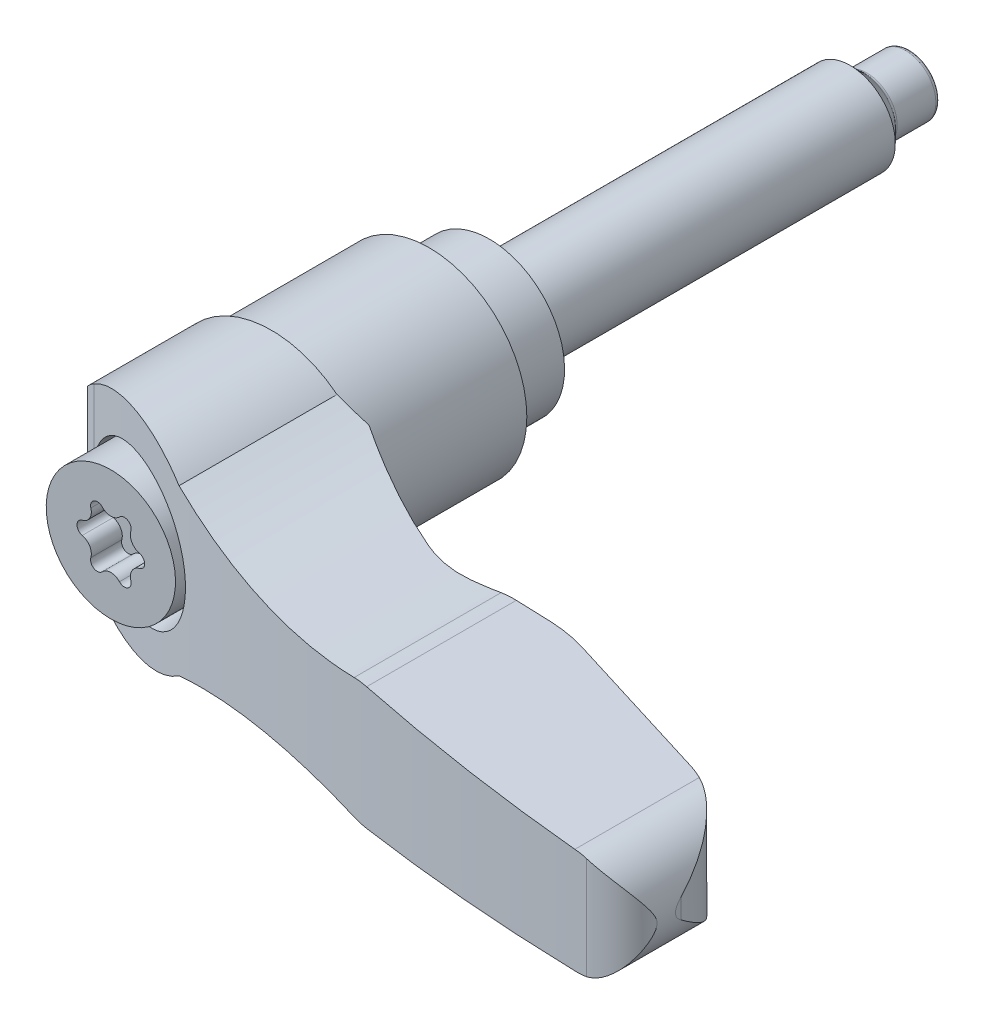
ISO-10303-21;
HEADER;
FILE_DESCRIPTION(('STEP AP214'),'2;1');
FILE_NAME('part.step','',(''),(''),'','','');
FILE_SCHEMA(('AUTOMOTIVE_DESIGN { 1 0 10303 214 1 1 1 1 }'));
ENDSEC;
DATA;
#1=APPLICATION_CONTEXT('core data for automotive mechanical design processes');
#2=APPLICATION_PROTOCOL_DEFINITION('international standard','automotive_design',2000,#1);
#3=PRODUCT_CONTEXT('',#1,'mechanical');
#4=PRODUCT('Part','Part','',(#3));
#5=PRODUCT_RELATED_PRODUCT_CATEGORY('part','',(#4));
#6=PRODUCT_DEFINITION_FORMATION('','',#4);
#7=PRODUCT_DEFINITION_CONTEXT('part definition',#1,'design');
#8=PRODUCT_DEFINITION('design','',#6,#7);
#9=PRODUCT_DEFINITION_SHAPE('','',#8);
#10=(LENGTH_UNIT() NAMED_UNIT(*) SI_UNIT(.MILLI.,.METRE.));
#11=(NAMED_UNIT(*) PLANE_ANGLE_UNIT() SI_UNIT($,.RADIAN.));
#12=(NAMED_UNIT(*) SI_UNIT($,.STERADIAN.) SOLID_ANGLE_UNIT());
#13=UNCERTAINTY_MEASURE_WITH_UNIT(LENGTH_MEASURE(1.E-05),#10,'distance_accuracy_value','');
#14=(GEOMETRIC_REPRESENTATION_CONTEXT(3) GLOBAL_UNCERTAINTY_ASSIGNED_CONTEXT((#13)) GLOBAL_UNIT_ASSIGNED_CONTEXT((#10,
#11,#12)) REPRESENTATION_CONTEXT('',''));
#15=CARTESIAN_POINT('',(0.,0.,0.));
#16=DIRECTION('',(0.,0.,1.));
#17=DIRECTION('',(1.,0.,0.));
#18=AXIS2_PLACEMENT_3D('',#15,#16,#17);
#19=CARTESIAN_POINT('',(0.,0.,82.));
#20=DIRECTION('',(0.,0.,1.));
#21=DIRECTION('',(-1.,0.,0.));
#22=AXIS2_PLACEMENT_3D('',#19,#20,#21);
#23=CYLINDRICAL_SURFACE('',#22,3.);
#24=CARTESIAN_POINT('',(0.,0.,0.));
#25=DIRECTION('',(0.,0.,-1.));
#26=DIRECTION('',(0.707106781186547,0.707106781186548,0.));
#27=AXIS2_PLACEMENT_3D('',#24,#25,#26);
#28=CIRCLE('',#27,3.);
#29=CARTESIAN_POINT('',(2.12132034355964,2.12132034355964,0.));
#30=VERTEX_POINT('',#29);
#31=EDGE_CURVE('E9',#30,#30,#28,.T.);
#32=ORIENTED_EDGE('',*,*,#31,.T.);
#33=EDGE_LOOP('',(#32));
#34=FACE_BOUND('',#33,.T.);
#35=CARTESIAN_POINT('',(0.,0.,-24.));
#36=DIRECTION('',(0.,0.,1.));
#37=DIRECTION('',(-1.,0.,0.));
#38=AXIS2_PLACEMENT_3D('',#35,#36,#37);
#39=CIRCLE('',#38,3.);
#40=CARTESIAN_POINT('',(-2.99999999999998,0.,-24.));
#41=VERTEX_POINT('',#40);
#42=EDGE_CURVE('E281',#41,#41,#39,.F.);
#43=ORIENTED_EDGE('',*,*,#42,.F.);
#44=EDGE_LOOP('',(#43));
#45=FACE_BOUND('',#44,.T.);
#46=ADVANCED_FACE('F14',(#34,#45),#23,.T.);
#47=CARTESIAN_POINT('',(0.,0.,-25.));
#48=DIRECTION('',(0.,0.,1.));
#49=DIRECTION('',(-1.,0.,0.));
#50=AXIS2_PLACEMENT_3D('',#47,#48,#49);
#51=CONICAL_SURFACE('',#50,2.,0.785398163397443);
#52=CARTESIAN_POINT('',(0.,0.,-24.9121320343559));
#53=DIRECTION('',(0.,0.,1.));
#54=DIRECTION('',(-1.,0.,0.));
#55=AXIS2_PLACEMENT_3D('',#52,#53,#54);
#56=CIRCLE('',#55,2.08786796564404);
#57=CARTESIAN_POINT('',(-2.08786796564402,0.,-24.9121320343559));
#58=VERTEX_POINT('',#57);
#59=EDGE_CURVE('E24',#58,#58,#56,.T.);
#60=ORIENTED_EDGE('',*,*,#59,.T.);
#61=EDGE_LOOP('',(#60));
#62=FACE_BOUND('',#61,.T.);
#63=ORIENTED_EDGE('',*,*,#42,.T.);
#64=EDGE_LOOP('',(#63));
#65=FACE_BOUND('',#64,.T.);
#66=ADVANCED_FACE('F615',(#62,#65),#51,.T.);
#67=CARTESIAN_POINT('',(0.,0.,-32.2163989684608));
#68=DIRECTION('',(0.,0.,-1.));
#69=DIRECTION('',(1.,0.,0.));
#70=AXIS2_PLACEMENT_3D('',#67,#68,#69);
#71=CYLINDRICAL_SURFACE('',#70,2.);
#72=CARTESIAN_POINT('',(0.,0.,-27.7));
#73=DIRECTION('',(0.,0.,1.));
#74=DIRECTION('',(-1.,0.,0.));
#75=AXIS2_PLACEMENT_3D('',#72,#73,#74);
#76=CIRCLE('',#75,2.);
#77=CARTESIAN_POINT('',(-1.99999999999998,0.,-27.7));
#78=VERTEX_POINT('',#77);
#79=EDGE_CURVE('E1354',#78,#78,#76,.T.);
#80=ORIENTED_EDGE('',*,*,#79,.T.);
#81=EDGE_LOOP('',(#80));
#82=FACE_BOUND('',#81,.T.);
#83=CARTESIAN_POINT('',(0.,0.,-25.1242640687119));
#84=DIRECTION('',(0.,0.,-1.));
#85=DIRECTION('',(1.,0.,0.));
#86=AXIS2_PLACEMENT_3D('',#83,#84,#85);
#87=CIRCLE('',#86,2.);
#88=CARTESIAN_POINT('',(2.00000000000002,0.,-25.1242640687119));
#89=VERTEX_POINT('',#88);
#90=EDGE_CURVE('E1357',#89,#89,#87,.T.);
#91=ORIENTED_EDGE('',*,*,#90,.T.);
#92=EDGE_LOOP('',(#91));
#93=FACE_BOUND('',#92,.T.);
#94=ADVANCED_FACE('F621',(#82,#93),#71,.T.);
#95=CARTESIAN_POINT('',(0.,0.,-28.));
#96=DIRECTION('',(0.,0.,1.));
#97=DIRECTION('',(-1.,0.,0.));
#98=AXIS2_PLACEMENT_3D('',#95,#96,#97);
#99=PLANE('',#98);
#100=CARTESIAN_POINT('',(0.,0.,-28.));
#101=DIRECTION('',(0.,0.,1.));
#102=DIRECTION('',(-1.,0.,0.));
#103=AXIS2_PLACEMENT_3D('',#100,#101,#102);
#104=CIRCLE('',#103,1.7);
#105=CARTESIAN_POINT('',(-1.69999999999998,0.,-28.));
#106=VERTEX_POINT('',#105);
#107=EDGE_CURVE('E1359',#106,#106,#104,.F.);
#108=ORIENTED_EDGE('',*,*,#107,.T.);
#109=EDGE_LOOP('',(#108));
#110=FACE_BOUND('',#109,.T.);
#111=ADVANCED_FACE('F627',(#110),#99,.F.);
#112=CARTESIAN_POINT('',(0.,0.,-27.7));
#113=DIRECTION('',(0.,0.,1.));
#114=DIRECTION('',(-1.,0.,0.));
#115=AXIS2_PLACEMENT_3D('',#112,#113,#114);
#116=TOROIDAL_SURFACE('',#115,1.7,0.3);
#117=ORIENTED_EDGE('',*,*,#79,.F.);
#118=EDGE_LOOP('',(#117));
#119=FACE_BOUND('',#118,.T.);
#120=ORIENTED_EDGE('',*,*,#107,.F.);
#121=EDGE_LOOP('',(#120));
#122=FACE_BOUND('',#121,.T.);
#123=ADVANCED_FACE('F630',(#119,#122),#116,.T.);
#124=CARTESIAN_POINT('',(0.,0.,-25.1242640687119));
#125=DIRECTION('',(0.,0.,-1.));
#126=DIRECTION('',(1.,0.,0.));
#127=AXIS2_PLACEMENT_3D('',#124,#125,#126);
#128=TOROIDAL_SURFACE('',#127,2.3,0.3);
#129=ORIENTED_EDGE('',*,*,#59,.F.);
#130=EDGE_LOOP('',(#129));
#131=FACE_BOUND('',#130,.T.);
#132=ORIENTED_EDGE('',*,*,#90,.F.);
#133=EDGE_LOOP('',(#132));
#134=FACE_BOUND('',#133,.T.);
#135=ADVANCED_FACE('F635',(#131,#134),#128,.F.);
#136=CARTESIAN_POINT('',(-1.94278209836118,0.602050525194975,23.12));
#137=DIRECTION('',(0.,0.,-1.));
#138=DIRECTION('',(0.,1.,0.));
#139=AXIS2_PLACEMENT_3D('',#136,#137,#138);
#140=PLANE('',#139);
#141=CARTESIAN_POINT('',(-2.08556419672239,1.20410105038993,23.12));
#142=DIRECTION('',(0.,0.,-1.));
#143=DIRECTION('',(-1.,0.,0.));
#144=AXIS2_PLACEMENT_3D('',#141,#142,#143);
#145=CIRCLE('',#144,0.787499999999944);
#146=CARTESIAN_POINT('',(-1.3311142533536,1.4298476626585,23.12));
#147=VERTEX_POINT('',#146);
#148=CARTESIAN_POINT('',(-1.90384152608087,0.437854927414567,23.12));
#149=VERTEX_POINT('',#148);
#150=EDGE_CURVE('E319',#147,#149,#145,.T.);
#151=ORIENTED_EDGE('',*,*,#150,.T.);
#152=CARTESIAN_POINT('',(-1.79999999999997,0.,23.12));
#153=DIRECTION('',(0.,0.,1.));
#154=DIRECTION('',(1.,0.,0.));
#155=AXIS2_PLACEMENT_3D('',#152,#153,#154);
#156=CIRCLE('',#155,0.45);
#157=CARTESIAN_POINT('',(-1.90384152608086,-0.437854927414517,23.12));
#158=VERTEX_POINT('',#157);
#159=EDGE_CURVE('E1368',#149,#158,#156,.T.);
#160=ORIENTED_EDGE('',*,*,#159,.T.);
#161=CARTESIAN_POINT('',(-2.08556419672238,-1.20410105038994,23.12));
#162=DIRECTION('',(0.,0.,-1.));
#163=DIRECTION('',(-1.,0.,0.));
#164=AXIS2_PLACEMENT_3D('',#161,#162,#163);
#165=CIRCLE('',#164,0.787499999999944);
#166=CARTESIAN_POINT('',(-1.33111425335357,-1.42984766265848,23.12));
#167=VERTEX_POINT('',#166);
#168=EDGE_CURVE('E262',#158,#167,#165,.T.);
#169=ORIENTED_EDGE('',*,*,#168,.T.);
#170=CARTESIAN_POINT('',(-0.899999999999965,-1.55884572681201,23.12));
#171=DIRECTION('',(0.,0.,1.));
#172=DIRECTION('',(1.,0.,0.));
#173=AXIS2_PLACEMENT_3D('',#170,#171,#172);
#174=CIRCLE('',#173,0.45);
#175=CARTESIAN_POINT('',(-0.572727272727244,-1.86770259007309,23.12));
#176=VERTEX_POINT('',#175);
#177=EDGE_CURVE('E1373',#167,#176,#174,.T.);
#178=ORIENTED_EDGE('',*,*,#177,.T.);
#179=CARTESIAN_POINT('',(0.,-2.40820210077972,23.12));
#180=DIRECTION('',(0.,0.,-1.));
#181=DIRECTION('',(-1.,0.,0.));
#182=AXIS2_PLACEMENT_3D('',#179,#180,#181);
#183=CIRCLE('',#182,0.787499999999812);
#184=CARTESIAN_POINT('',(0.572727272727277,-1.8677025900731,23.12));
#185=VERTEX_POINT('',#184);
#186=EDGE_CURVE('E1377',#176,#185,#183,.T.);
#187=ORIENTED_EDGE('',*,*,#186,.T.);
#188=CARTESIAN_POINT('',(0.899999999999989,-1.55884572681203,23.12));
#189=DIRECTION('',(0.,0.,1.));
#190=DIRECTION('',(-1.,0.,0.));
#191=AXIS2_PLACEMENT_3D('',#188,#189,#190);
#192=CIRCLE('',#191,0.45);
#193=CARTESIAN_POINT('',(1.33111425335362,-1.42984766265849,23.12));
#194=VERTEX_POINT('',#193);
#195=EDGE_CURVE('E1381',#185,#194,#192,.T.);
#196=ORIENTED_EDGE('',*,*,#195,.T.);
#197=CARTESIAN_POINT('',(2.08556419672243,-1.20410105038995,23.12));
#198=DIRECTION('',(0.,0.,-1.));
#199=DIRECTION('',(1.,0.,0.));
#200=AXIS2_PLACEMENT_3D('',#197,#198,#199);
#201=CIRCLE('',#200,0.787499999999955);
#202=CARTESIAN_POINT('',(1.90384152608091,-0.437854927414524,23.12));
#203=VERTEX_POINT('',#202);
#204=EDGE_CURVE('E1385',#194,#203,#201,.T.);
#205=ORIENTED_EDGE('',*,*,#204,.T.);
#206=CARTESIAN_POINT('',(1.8,0.,23.12));
#207=DIRECTION('',(0.,0.,1.));
#208=DIRECTION('',(-1.,0.,0.));
#209=AXIS2_PLACEMENT_3D('',#206,#207,#208);
#210=CIRCLE('',#209,0.45);
#211=CARTESIAN_POINT('',(1.90384152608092,0.43785492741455,23.12));
#212=VERTEX_POINT('',#211);
#213=EDGE_CURVE('E1389',#203,#212,#210,.T.);
#214=ORIENTED_EDGE('',*,*,#213,.T.);
#215=CARTESIAN_POINT('',(2.08556419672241,1.20410105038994,23.12));
#216=DIRECTION('',(0.,0.,-1.));
#217=DIRECTION('',(1.,0.,0.));
#218=AXIS2_PLACEMENT_3D('',#215,#216,#217);
#219=CIRCLE('',#218,0.787499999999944);
#220=CARTESIAN_POINT('',(1.33111425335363,1.42984766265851,23.12));
#221=VERTEX_POINT('',#220);
#222=EDGE_CURVE('E1393',#212,#221,#219,.T.);
#223=ORIENTED_EDGE('',*,*,#222,.T.);
#224=CARTESIAN_POINT('',(0.9,1.558845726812,23.12));
#225=DIRECTION('',(0.,0.,1.));
#226=DIRECTION('',(-1.,0.,0.));
#227=AXIS2_PLACEMENT_3D('',#224,#225,#226);
#228=CIRCLE('',#227,0.45);
#229=CARTESIAN_POINT('',(0.572727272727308,1.86770259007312,23.12));
#230=VERTEX_POINT('',#229);
#231=EDGE_CURVE('E1397',#221,#230,#228,.T.);
#232=ORIENTED_EDGE('',*,*,#231,.T.);
#233=CARTESIAN_POINT('',(0.,2.40820210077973,23.12));
#234=DIRECTION('',(0.,0.,-1.));
#235=DIRECTION('',(-1.,0.,0.));
#236=AXIS2_PLACEMENT_3D('',#233,#234,#235);
#237=CIRCLE('',#236,0.787499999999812);
#238=CARTESIAN_POINT('',(-0.572727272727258,1.8677025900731,23.12));
#239=VERTEX_POINT('',#238);
#240=EDGE_CURVE('E1401',#230,#239,#237,.T.);
#241=ORIENTED_EDGE('',*,*,#240,.T.);
#242=CARTESIAN_POINT('',(-0.899999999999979,1.55884572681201,23.12));
#243=DIRECTION('',(0.,0.,1.));
#244=DIRECTION('',(1.,0.,0.));
#245=AXIS2_PLACEMENT_3D('',#242,#243,#244);
#246=CIRCLE('',#245,0.45);
#247=EDGE_CURVE('E1405',#239,#147,#246,.T.);
#248=ORIENTED_EDGE('',*,*,#247,.T.);
#249=EDGE_LOOP('',(#151,#160,#169,#178,#187,#196,#205,#214,#223,#232,#241,#248));
#250=FACE_BOUND('',#249,.T.);
#251=ADVANCED_FACE('F632',(#250),#140,.F.);
#252=CARTESIAN_POINT('',(-2.08556419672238,-1.20410105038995,27.24));
#253=DIRECTION('',(0.,0.,-1.));
#254=DIRECTION('',(0.,1.,0.));
#255=AXIS2_PLACEMENT_3D('',#252,#253,#254);
#256=CYLINDRICAL_SURFACE('',#255,0.787499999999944);
#257=DIRECTION('',(0.,0.,-1.));
#258=VECTOR('',#257,1.);
#259=CARTESIAN_POINT('',(-1.33111425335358,-1.42984766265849,27.24));
#260=LINE('',#259,#258);
#261=CARTESIAN_POINT('',(-1.3311142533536,-1.4298476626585,25.18));
#262=VERTEX_POINT('',#261);
#263=EDGE_CURVE('E263',#262,#167,#260,.T.);
#264=ORIENTED_EDGE('',*,*,#263,.T.);
#265=ORIENTED_EDGE('',*,*,#168,.F.);
#266=DIRECTION('',(0.,0.,-1.));
#267=VECTOR('',#266,1.);
#268=CARTESIAN_POINT('',(-1.90384152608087,-0.437854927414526,27.24));
#269=LINE('',#268,#267);
#270=CARTESIAN_POINT('',(-1.90384152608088,-0.437854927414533,25.18));
#271=VERTEX_POINT('',#270);
#272=EDGE_CURVE('E249',#271,#158,#269,.T.);
#273=ORIENTED_EDGE('',*,*,#272,.F.);
#274=CARTESIAN_POINT('',(-2.08556419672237,-1.20410105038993,25.18));
#275=DIRECTION('',(0.,0.,1.));
#276=DIRECTION('',(0.,-1.,0.));
#277=AXIS2_PLACEMENT_3D('',#274,#275,#276);
#278=CIRCLE('',#277,0.787499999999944);
#279=EDGE_CURVE('E255',#262,#271,#278,.T.);
#280=ORIENTED_EDGE('',*,*,#279,.F.);
#281=EDGE_LOOP('',(#264,#265,#273,#280));
#282=FACE_BOUND('',#281,.T.);
#283=ADVANCED_FACE('F259',(#282),#256,.T.);
#284=CARTESIAN_POINT('',(-0.899999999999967,-1.55884572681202,27.24));
#285=DIRECTION('',(0.,0.,-1.));
#286=DIRECTION('',(0.,1.,0.));
#287=AXIS2_PLACEMENT_3D('',#284,#285,#286);
#288=CYLINDRICAL_SURFACE('',#287,0.45);
#289=DIRECTION('',(0.,0.,-1.));
#290=VECTOR('',#289,1.);
#291=CARTESIAN_POINT('',(-0.572727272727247,-1.8677025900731,27.24));
#292=LINE('',#291,#290);
#293=CARTESIAN_POINT('',(-0.572727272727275,-1.86770259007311,25.18));
#294=VERTEX_POINT('',#293);
#295=EDGE_CURVE('E1427',#294,#176,#292,.T.);
#296=ORIENTED_EDGE('',*,*,#295,.T.);
#297=ORIENTED_EDGE('',*,*,#177,.F.);
#298=ORIENTED_EDGE('',*,*,#263,.F.);
#299=CARTESIAN_POINT('',(-0.899999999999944,-1.55884572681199,25.18));
#300=DIRECTION('',(0.,0.,1.));
#301=DIRECTION('',(0.,-1.,0.));
#302=AXIS2_PLACEMENT_3D('',#299,#300,#301);
#303=CIRCLE('',#302,0.45);
#304=EDGE_CURVE('E268',#294,#262,#303,.F.);
#305=ORIENTED_EDGE('',*,*,#304,.F.);
#306=EDGE_LOOP('',(#296,#297,#298,#305));
#307=FACE_BOUND('',#306,.T.);
#308=ADVANCED_FACE('F668',(#307),#288,.F.);
#309=CARTESIAN_POINT('',(0.,-2.40820210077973,27.24));
#310=DIRECTION('',(0.,0.,-1.));
#311=DIRECTION('',(0.,1.,0.));
#312=AXIS2_PLACEMENT_3D('',#309,#310,#311);
#313=CYLINDRICAL_SURFACE('',#312,0.787499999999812);
#314=DIRECTION('',(0.,0.,-1.));
#315=VECTOR('',#314,1.);
#316=CARTESIAN_POINT('',(0.572727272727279,-1.86770259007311,27.24));
#317=LINE('',#316,#315);
#318=CARTESIAN_POINT('',(0.572727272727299,-1.86770259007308,25.18));
#319=VERTEX_POINT('',#318);
#320=EDGE_CURVE('E1425',#319,#185,#317,.T.);
#321=ORIENTED_EDGE('',*,*,#320,.T.);
#322=ORIENTED_EDGE('',*,*,#186,.F.);
#323=ORIENTED_EDGE('',*,*,#295,.F.);
#324=CARTESIAN_POINT('',(0.,-2.40820210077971,25.18));
#325=DIRECTION('',(0.,0.,1.));
#326=DIRECTION('',(0.,-1.,0.));
#327=AXIS2_PLACEMENT_3D('',#324,#325,#326);
#328=CIRCLE('',#327,0.787499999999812);
#329=EDGE_CURVE('E270',#319,#294,#328,.T.);
#330=ORIENTED_EDGE('',*,*,#329,.F.);
#331=EDGE_LOOP('',(#321,#322,#323,#330));
#332=FACE_BOUND('',#331,.T.);
#333=ADVANCED_FACE('F664',(#332),#313,.T.);
#334=CARTESIAN_POINT('',(0.9,-1.55884572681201,27.24));
#335=DIRECTION('',(0.,0.,-1.));
#336=DIRECTION('',(0.,1.,0.));
#337=AXIS2_PLACEMENT_3D('',#334,#335,#336);
#338=CYLINDRICAL_SURFACE('',#337,0.45);
#339=DIRECTION('',(0.,0.,-1.));
#340=VECTOR('',#339,1.);
#341=CARTESIAN_POINT('',(1.33111425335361,-1.4298476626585,27.24));
#342=LINE('',#341,#340);
#343=CARTESIAN_POINT('',(1.3311142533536,-1.42984766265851,25.18));
#344=VERTEX_POINT('',#343);
#345=EDGE_CURVE('E1423',#344,#194,#342,.T.);
#346=ORIENTED_EDGE('',*,*,#345,.T.);
#347=ORIENTED_EDGE('',*,*,#195,.F.);
#348=ORIENTED_EDGE('',*,*,#320,.F.);
#349=CARTESIAN_POINT('',(0.9,-1.558845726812,25.18));
#350=DIRECTION('',(0.,0.,1.));
#351=DIRECTION('',(0.,-1.,0.));
#352=AXIS2_PLACEMENT_3D('',#349,#350,#351);
#353=CIRCLE('',#352,0.45);
#354=EDGE_CURVE('E1455',#344,#319,#353,.F.);
#355=ORIENTED_EDGE('',*,*,#354,.F.);
#356=EDGE_LOOP('',(#346,#347,#348,#355));
#357=FACE_BOUND('',#356,.T.);
#358=ADVANCED_FACE('F660',(#357),#338,.F.);
#359=CARTESIAN_POINT('',(2.08556419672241,-1.20410105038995,27.24));
#360=DIRECTION('',(0.,0.,-1.));
#361=DIRECTION('',(0.,1.,0.));
#362=AXIS2_PLACEMENT_3D('',#359,#360,#361);
#363=CYLINDRICAL_SURFACE('',#362,0.787499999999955);
#364=DIRECTION('',(0.,0.,-1.));
#365=VECTOR('',#364,1.);
#366=CARTESIAN_POINT('',(1.90384152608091,-0.437854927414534,27.24));
#367=LINE('',#366,#365);
#368=CARTESIAN_POINT('',(1.9038415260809,-0.43785492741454,25.18));
#369=VERTEX_POINT('',#368);
#370=EDGE_CURVE('E1421',#369,#203,#367,.T.);
#371=ORIENTED_EDGE('',*,*,#370,.T.);
#372=ORIENTED_EDGE('',*,*,#204,.F.);
#373=ORIENTED_EDGE('',*,*,#345,.F.);
#374=CARTESIAN_POINT('',(2.08556419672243,-1.20410105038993,25.18));
#375=DIRECTION('',(0.,0.,1.));
#376=DIRECTION('',(0.,-1.,0.));
#377=AXIS2_PLACEMENT_3D('',#374,#375,#376);
#378=CIRCLE('',#377,0.787499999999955);
#379=EDGE_CURVE('E1452',#369,#344,#378,.T.);
#380=ORIENTED_EDGE('',*,*,#379,.F.);
#381=EDGE_LOOP('',(#371,#372,#373,#380));
#382=FACE_BOUND('',#381,.T.);
#383=ADVANCED_FACE('F656',(#382),#363,.T.);
#384=CARTESIAN_POINT('',(1.8,0.,27.24));
#385=DIRECTION('',(0.,0.,-1.));
#386=DIRECTION('',(0.,1.,0.));
#387=AXIS2_PLACEMENT_3D('',#384,#385,#386);
#388=CYLINDRICAL_SURFACE('',#387,0.45);
#389=DIRECTION('',(0.,0.,-1.));
#390=VECTOR('',#389,1.);
#391=CARTESIAN_POINT('',(1.90384152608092,0.437854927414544,27.24));
#392=LINE('',#391,#390);
#393=CARTESIAN_POINT('',(1.9038415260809,0.437854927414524,25.18));
#394=VERTEX_POINT('',#393);
#395=EDGE_CURVE('E1419',#394,#212,#392,.T.);
#396=ORIENTED_EDGE('',*,*,#395,.T.);
#397=ORIENTED_EDGE('',*,*,#213,.F.);
#398=ORIENTED_EDGE('',*,*,#370,.F.);
#399=CARTESIAN_POINT('',(1.8,0.,25.18));
#400=DIRECTION('',(0.,0.,1.));
#401=DIRECTION('',(0.,-1.,0.));
#402=AXIS2_PLACEMENT_3D('',#399,#400,#401);
#403=CIRCLE('',#402,0.45);
#404=EDGE_CURVE('E1449',#394,#369,#403,.F.);
#405=ORIENTED_EDGE('',*,*,#404,.F.);
#406=EDGE_LOOP('',(#396,#397,#398,#405));
#407=FACE_BOUND('',#406,.T.);
#408=ADVANCED_FACE('F652',(#407),#388,.F.);
#409=CARTESIAN_POINT('',(2.0855641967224,1.20410105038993,27.24));
#410=DIRECTION('',(0.,0.,-1.));
#411=DIRECTION('',(0.,1.,0.));
#412=AXIS2_PLACEMENT_3D('',#409,#410,#411);
#413=CYLINDRICAL_SURFACE('',#412,0.787499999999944);
#414=DIRECTION('',(0.,0.,-1.));
#415=VECTOR('',#414,1.);
#416=CARTESIAN_POINT('',(1.33111425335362,1.42984766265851,27.24));
#417=LINE('',#416,#415);
#418=CARTESIAN_POINT('',(1.33111425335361,1.4298476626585,25.18));
#419=VERTEX_POINT('',#418);
#420=EDGE_CURVE('E1417',#419,#221,#417,.T.);
#421=ORIENTED_EDGE('',*,*,#420,.T.);
#422=ORIENTED_EDGE('',*,*,#222,.F.);
#423=ORIENTED_EDGE('',*,*,#395,.F.);
#424=CARTESIAN_POINT('',(2.08556419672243,1.20410105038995,25.18));
#425=DIRECTION('',(0.,0.,1.));
#426=DIRECTION('',(0.,-1.,0.));
#427=AXIS2_PLACEMENT_3D('',#424,#425,#426);
#428=CIRCLE('',#427,0.787499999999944);
#429=EDGE_CURVE('E1446',#419,#394,#428,.T.);
#430=ORIENTED_EDGE('',*,*,#429,.F.);
#431=EDGE_LOOP('',(#421,#422,#423,#430));
#432=FACE_BOUND('',#431,.T.);
#433=ADVANCED_FACE('F648',(#432),#413,.T.);
#434=CARTESIAN_POINT('',(0.900000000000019,1.55884572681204,27.24));
#435=DIRECTION('',(0.,0.,-1.));
#436=DIRECTION('',(0.,1.,0.));
#437=AXIS2_PLACEMENT_3D('',#434,#435,#436);
#438=CYLINDRICAL_SURFACE('',#437,0.45);
#439=DIRECTION('',(0.,0.,-1.));
#440=VECTOR('',#439,1.);
#441=CARTESIAN_POINT('',(0.572727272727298,1.86770259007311,27.24));
#442=LINE('',#441,#440);
#443=CARTESIAN_POINT('',(0.572727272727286,1.86770259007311,25.18));
#444=VERTEX_POINT('',#443);
#445=EDGE_CURVE('E1415',#444,#230,#442,.T.);
#446=ORIENTED_EDGE('',*,*,#445,.T.);
#447=ORIENTED_EDGE('',*,*,#231,.F.);
#448=ORIENTED_EDGE('',*,*,#420,.F.);
#449=CARTESIAN_POINT('',(0.9,1.55884572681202,25.18));
#450=DIRECTION('',(0.,0.,1.));
#451=DIRECTION('',(0.,-1.,0.));
#452=AXIS2_PLACEMENT_3D('',#449,#450,#451);
#453=CIRCLE('',#452,0.45);
#454=EDGE_CURVE('E1443',#444,#419,#453,.F.);
#455=ORIENTED_EDGE('',*,*,#454,.F.);
#456=EDGE_LOOP('',(#446,#447,#448,#455));
#457=FACE_BOUND('',#456,.T.);
#458=ADVANCED_FACE('F644',(#457),#438,.F.);
#459=CARTESIAN_POINT('',(0.,2.40820210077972,27.24));
#460=DIRECTION('',(0.,0.,-1.));
#461=DIRECTION('',(0.,1.,0.));
#462=AXIS2_PLACEMENT_3D('',#459,#460,#461);
#463=CYLINDRICAL_SURFACE('',#462,0.787499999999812);
#464=DIRECTION('',(0.,0.,-1.));
#465=VECTOR('',#464,1.);
#466=CARTESIAN_POINT('',(-0.572727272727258,1.8677025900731,27.24));
#467=LINE('',#466,#465);
#468=CARTESIAN_POINT('',(-0.572727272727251,1.86770259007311,25.18));
#469=VERTEX_POINT('',#468);
#470=EDGE_CURVE('E33',#469,#239,#467,.T.);
#471=ORIENTED_EDGE('',*,*,#470,.T.);
#472=ORIENTED_EDGE('',*,*,#240,.F.);
#473=ORIENTED_EDGE('',*,*,#445,.F.);
#474=CARTESIAN_POINT('',(0.,2.40820210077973,25.18));
#475=DIRECTION('',(0.,0.,1.));
#476=DIRECTION('',(0.,-1.,0.));
#477=AXIS2_PLACEMENT_3D('',#474,#475,#476);
#478=CIRCLE('',#477,0.787499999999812);
#479=EDGE_CURVE('E1440',#469,#444,#478,.T.);
#480=ORIENTED_EDGE('',*,*,#479,.F.);
#481=EDGE_LOOP('',(#471,#472,#473,#480));
#482=FACE_BOUND('',#481,.T.);
#483=ADVANCED_FACE('F641',(#482),#463,.T.);
#484=CARTESIAN_POINT('',(-0.899999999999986,1.55884572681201,27.24));
#485=DIRECTION('',(0.,0.,-1.));
#486=DIRECTION('',(0.,1.,0.));
#487=AXIS2_PLACEMENT_3D('',#484,#485,#486);
#488=CYLINDRICAL_SURFACE('',#487,0.45);
#489=DIRECTION('',(0.,0.,-1.));
#490=VECTOR('',#489,1.);
#491=CARTESIAN_POINT('',(-1.33111425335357,1.42984766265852,27.24));
#492=LINE('',#491,#490);
#493=CARTESIAN_POINT('',(-1.33111425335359,1.4298476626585,25.18));
#494=VERTEX_POINT('',#493);
#495=EDGE_CURVE('E1409',#494,#147,#492,.T.);
#496=ORIENTED_EDGE('',*,*,#495,.T.);
#497=ORIENTED_EDGE('',*,*,#247,.F.);
#498=ORIENTED_EDGE('',*,*,#470,.F.);
#499=CARTESIAN_POINT('',(-0.899999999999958,1.55884572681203,25.18));
#500=DIRECTION('',(0.,0.,1.));
#501=DIRECTION('',(0.,-1.,0.));
#502=AXIS2_PLACEMENT_3D('',#499,#500,#501);
#503=CIRCLE('',#502,0.45);
#504=EDGE_CURVE('E1437',#494,#469,#503,.F.);
#505=ORIENTED_EDGE('',*,*,#504,.F.);
#506=EDGE_LOOP('',(#496,#497,#498,#505));
#507=FACE_BOUND('',#506,.T.);
#508=ADVANCED_FACE('F637',(#507),#488,.F.);
#509=CARTESIAN_POINT('',(-2.08556419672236,1.20410105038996,27.24));
#510=DIRECTION('',(0.,0.,-1.));
#511=DIRECTION('',(0.,1.,0.));
#512=AXIS2_PLACEMENT_3D('',#509,#510,#511);
#513=CYLINDRICAL_SURFACE('',#512,0.787499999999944);
#514=DIRECTION('',(0.,0.,-1.));
#515=VECTOR('',#514,1.);
#516=CARTESIAN_POINT('',(-1.90384152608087,0.437854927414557,27.24));
#517=LINE('',#516,#515);
#518=CARTESIAN_POINT('',(-1.90384152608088,0.43785492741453,25.18));
#519=VERTEX_POINT('',#518);
#520=EDGE_CURVE('E184',#519,#149,#517,.T.);
#521=ORIENTED_EDGE('',*,*,#520,.T.);
#522=ORIENTED_EDGE('',*,*,#150,.F.);
#523=ORIENTED_EDGE('',*,*,#495,.F.);
#524=CARTESIAN_POINT('',(-2.08556419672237,1.20410105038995,25.18));
#525=DIRECTION('',(0.,0.,1.));
#526=DIRECTION('',(0.,-1.,0.));
#527=AXIS2_PLACEMENT_3D('',#524,#525,#526);
#528=CIRCLE('',#527,0.787499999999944);
#529=EDGE_CURVE('E254',#519,#494,#528,.T.);
#530=ORIENTED_EDGE('',*,*,#529,.F.);
#531=EDGE_LOOP('',(#521,#522,#523,#530));
#532=FACE_BOUND('',#531,.T.);
#533=ADVANCED_FACE('F640',(#532),#513,.T.);
#534=CARTESIAN_POINT('',(-1.79999999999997,0.,27.24));
#535=DIRECTION('',(0.,0.,-1.));
#536=DIRECTION('',(0.,1.,0.));
#537=AXIS2_PLACEMENT_3D('',#534,#535,#536);
#538=CYLINDRICAL_SURFACE('',#537,0.45);
#539=ORIENTED_EDGE('',*,*,#272,.T.);
#540=ORIENTED_EDGE('',*,*,#159,.F.);
#541=ORIENTED_EDGE('',*,*,#520,.F.);
#542=CARTESIAN_POINT('',(-1.8,0.,25.18));
#543=DIRECTION('',(0.,0.,1.));
#544=DIRECTION('',(0.,-1.,0.));
#545=AXIS2_PLACEMENT_3D('',#542,#543,#544);
#546=CIRCLE('',#545,0.45);
#547=EDGE_CURVE('E246',#271,#519,#546,.F.);
#548=ORIENTED_EDGE('',*,*,#547,.F.);
#549=EDGE_LOOP('',(#539,#540,#541,#548));
#550=FACE_BOUND('',#549,.T.);
#551=ADVANCED_FACE('F248',(#550),#538,.F.);
#552=CARTESIAN_POINT('',(0.,0.,25.18));
#553=DIRECTION('',(0.,0.,1.));
#554=DIRECTION('',(0.,-1.,0.));
#555=AXIS2_PLACEMENT_3D('',#552,#553,#554);
#556=PLANE('',#555);
#557=CARTESIAN_POINT('',(0.,0.,25.18));
#558=DIRECTION('',(0.,0.,1.));
#559=DIRECTION('',(0.,-1.,0.));
#560=AXIS2_PLACEMENT_3D('',#557,#558,#559);
#561=CIRCLE('',#560,4.3);
#562=CARTESIAN_POINT('',(0.,-4.29999999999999,25.18));
#563=VERTEX_POINT('',#562);
#564=EDGE_CURVE('E1434',#563,#563,#561,.T.);
#565=ORIENTED_EDGE('',*,*,#564,.T.);
#566=EDGE_LOOP('',(#565));
#567=FACE_BOUND('',#566,.T.);
#568=ORIENTED_EDGE('',*,*,#547,.T.);
#569=ORIENTED_EDGE('',*,*,#529,.T.);
#570=ORIENTED_EDGE('',*,*,#504,.T.);
#571=ORIENTED_EDGE('',*,*,#479,.T.);
#572=ORIENTED_EDGE('',*,*,#454,.T.);
#573=ORIENTED_EDGE('',*,*,#429,.T.);
#574=ORIENTED_EDGE('',*,*,#404,.T.);
#575=ORIENTED_EDGE('',*,*,#379,.T.);
#576=ORIENTED_EDGE('',*,*,#354,.T.);
#577=ORIENTED_EDGE('',*,*,#329,.T.);
#578=ORIENTED_EDGE('',*,*,#304,.T.);
#579=ORIENTED_EDGE('',*,*,#279,.T.);
#580=EDGE_LOOP('',(#568,#569,#570,#571,#572,#573,#574,#575,#576,#577,#578,#579));
#581=FACE_BOUND('',#580,.T.);
#582=ADVANCED_FACE('F266',(#567,#581),#556,.T.);
#583=CARTESIAN_POINT('',(0.,0.,4.));
#584=DIRECTION('',(0.,0.,1.));
#585=DIRECTION('',(0.,-1.,0.));
#586=AXIS2_PLACEMENT_3D('',#583,#584,#585);
#587=CYLINDRICAL_SURFACE('',#586,4.3);
#588=CARTESIAN_POINT('',(0.,0.,21.5));
#589=DIRECTION('',(0.,0.,1.));
#590=DIRECTION('',(-0.707106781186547,-0.707106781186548,0.));
#591=AXIS2_PLACEMENT_3D('',#588,#589,#590);
#592=CIRCLE('',#591,4.3);
#593=CARTESIAN_POINT('',(-3.04055915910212,-3.04055915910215,21.5));
#594=VERTEX_POINT('',#593);
#595=EDGE_CURVE('E278',#594,#594,#592,.F.);
#596=ORIENTED_EDGE('',*,*,#595,.F.);
#597=EDGE_LOOP('',(#596));
#598=FACE_BOUND('',#597,.T.);
#599=ORIENTED_EDGE('',*,*,#564,.F.);
#600=EDGE_LOOP('',(#599));
#601=FACE_BOUND('',#600,.T.);
#602=ADVANCED_FACE('F679',(#598,#601),#587,.T.);
#603=CARTESIAN_POINT('',(39.9389658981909,-8.,27.204249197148));
#604=DIRECTION('',(-0.989626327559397,0.,0.143665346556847));
#605=DIRECTION('',(-0.143665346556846,0.,-0.989626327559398));
#606=AXIS2_PLACEMENT_3D('',#603,#604,#605);
#607=PLANE('',#606);
#608=CARTESIAN_POINT('',(36.5,0.,3.51522972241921));
#609=DIRECTION('',(-0.989626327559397,0.,0.143665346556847));
#610=DIRECTION('',(0.143665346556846,0.,0.989626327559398));
#611=AXIS2_PLACEMENT_3D('',#608,#609,#610);
#612=ELLIPSE('',#611,24.3621728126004,3.5);
#613=CARTESIAN_POINT('',(39.9389658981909,-0.65077918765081,27.204249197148));
#614=VERTEX_POINT('',#613);
#615=CARTESIAN_POINT('',(39.938965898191,0.65077918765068,27.204249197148));
#616=VERTEX_POINT('',#615);
#617=EDGE_CURVE('E584',#614,#616,#612,.T.);
#618=ORIENTED_EDGE('',*,*,#617,.F.);
#619=DIRECTION('',(0.,1.,0.));
#620=VECTOR('',#619,1.);
#621=CARTESIAN_POINT('',(39.9389658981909,-8.,27.204249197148));
#622=LINE('',#621,#620);
#623=EDGE_CURVE('E450',#614,#616,#622,.T.);
#624=ORIENTED_EDGE('',*,*,#623,.T.);
#625=EDGE_LOOP('',(#618,#624));
#626=FACE_BOUND('',#625,.T.);
#627=ADVANCED_FACE('F597',(#626),#607,.F.);
#628=CARTESIAN_POINT('',(0.,0.,21.5));
#629=DIRECTION('',(0.,0.,1.));
#630=DIRECTION('',(-1.,0.,0.));
#631=AXIS2_PLACEMENT_3D('',#628,#629,#630);
#632=PLANE('',#631);
#633=ORIENTED_EDGE('',*,*,#595,.T.);
#634=EDGE_LOOP('',(#633));
#635=FACE_BOUND('',#634,.T.);
#636=CARTESIAN_POINT('',(0.,0.,21.5));
#637=DIRECTION('',(0.,0.,1.));
#638=DIRECTION('',(-1.,0.,0.));
#639=AXIS2_PLACEMENT_3D('',#636,#637,#638);
#640=CIRCLE('',#639,4.32821231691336);
#641=CARTESIAN_POINT('',(-4.32821231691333,0.,21.5));
#642=VERTEX_POINT('',#641);
#643=EDGE_CURVE('E18',#642,#642,#640,.F.);
#644=ORIENTED_EDGE('',*,*,#643,.F.);
#645=EDGE_LOOP('',(#644));
#646=FACE_BOUND('',#645,.T.);
#647=ADVANCED_FACE('F306',(#635,#646),#632,.T.);
#648=CARTESIAN_POINT('',(25.51080482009,-8.,19.34192715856));
#649=DIRECTION('',(-0.272280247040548,0.,0.962217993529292));
#650=DIRECTION('',(-0.962217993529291,0.,-0.272280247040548));
#651=AXIS2_PLACEMENT_3D('',#648,#649,#650);
#652=PLANE('',#651);
#653=DIRECTION('',(-0.961608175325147,0.035596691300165,-0.272107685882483));
#654=VECTOR('',#653,1.);
#655=CARTESIAN_POINT('',(25.918375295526,3.89170926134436,19.457257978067));
#656=LINE('',#655,#654);
#657=CARTESIAN_POINT('',(35.5344609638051,3.53574220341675,22.178335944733));
#658=VERTEX_POINT('',#657);
#659=CARTESIAN_POINT('',(25.51080482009,3.90679665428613,19.34192715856));
#660=VERTEX_POINT('',#659);
#661=EDGE_CURVE('E1290',#658,#660,#656,.T.);
#662=ORIENTED_EDGE('',*,*,#661,.F.);
#663=DIRECTION('',(0.,1.,0.));
#664=VECTOR('',#663,1.);
#665=CARTESIAN_POINT('',(35.534460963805,-8.,22.178335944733));
#666=LINE('',#665,#664);
#667=CARTESIAN_POINT('',(35.5344609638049,-3.53574220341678,22.178335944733));
#668=VERTEX_POINT('',#667);
#669=EDGE_CURVE('E453',#668,#658,#666,.T.);
#670=ORIENTED_EDGE('',*,*,#669,.F.);
#671=DIRECTION('',(0.961608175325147,0.0355966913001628,0.272107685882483));
#672=VECTOR('',#671,1.);
#673=CARTESIAN_POINT('',(25.3706941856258,-3.91198325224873,19.3022798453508));
#674=LINE('',#673,#672);
#675=CARTESIAN_POINT('',(25.51080482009,-3.90679665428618,19.3419271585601));
#676=VERTEX_POINT('',#675);
#677=EDGE_CURVE('E1280',#676,#668,#674,.T.);
#678=ORIENTED_EDGE('',*,*,#677,.F.);
#679=DIRECTION('',(0.,1.,0.));
#680=VECTOR('',#679,1.);
#681=CARTESIAN_POINT('',(25.51080482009,-8.,19.34192715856));
#682=LINE('',#681,#680);
#683=EDGE_CURVE('E456',#676,#660,#682,.T.);
#684=ORIENTED_EDGE('',*,*,#683,.T.);
#685=EDGE_LOOP('',(#662,#670,#678,#684));
#686=FACE_BOUND('',#685,.T.);
#687=ADVANCED_FACE('F595',(#686),#652,.F.);
#688=CARTESIAN_POINT('',(33.8626602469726,-8.,28.0863544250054));
#689=DIRECTION('',(0.,1.,0.));
#690=DIRECTION('',(-1.,0.,0.));
#691=AXIS2_PLACEMENT_3D('',#688,#689,#690);
#692=CYLINDRICAL_SURFACE('',#691,6.14000000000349);
#693=CARTESIAN_POINT('',(33.8626602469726,3.59762871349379,28.0863544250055));
#694=DIRECTION('',(0.0369925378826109,0.999315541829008,0.));
#695=DIRECTION('',(-0.999315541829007,0.0369925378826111,0.));
#696=AXIS2_PLACEMENT_3D('',#693,#694,#695);
#697=ELLIPSE('',#696,6.14420545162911,6.14000000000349);
#698=CARTESIAN_POINT('',(36.5,3.49999999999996,22.5416236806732));
#699=VERTEX_POINT('',#698);
#700=EDGE_CURVE('E1289',#699,#658,#697,.T.);
#701=ORIENTED_EDGE('',*,*,#700,.F.);
#702=CARTESIAN_POINT('',(39.938965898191,0.65077918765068,27.204249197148));
#703=CARTESIAN_POINT('',(39.9247028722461,0.726086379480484,27.1059853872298));
#704=CARTESIAN_POINT('',(39.9079968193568,0.800887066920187,27.007686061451));
#705=CARTESIAN_POINT('',(39.8696347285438,0.949458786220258,26.8112602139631));
#706=CARTESIAN_POINT('',(39.8479781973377,1.0232297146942,26.7131337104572));
#707=CARTESIAN_POINT('',(39.7995979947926,1.16988012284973,26.5170899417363));
#708=CARTESIAN_POINT('',(39.7728626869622,1.24275713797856,26.4191736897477));
#709=CARTESIAN_POINT('',(39.7142815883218,1.38725410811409,26.2239599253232));
#710=CARTESIAN_POINT('',(39.6824358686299,1.45887408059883,26.1266624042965));
#711=CARTESIAN_POINT('',(39.5782917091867,1.67318502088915,25.8337016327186));
#712=CARTESIAN_POINT('',(39.4979263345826,1.8136636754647,25.6391889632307));
#713=CARTESIAN_POINT('',(39.3150854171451,2.08619457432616,25.2551202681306));
#714=CARTESIAN_POINT('',(39.2126344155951,2.21825596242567,25.0655590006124));
#715=CARTESIAN_POINT('',(38.9595027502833,2.49877334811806,24.6523338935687));
#716=CARTESIAN_POINT('',(38.8031801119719,2.64456339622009,24.4302018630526));
#717=CARTESIAN_POINT('',(38.5417124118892,2.84488994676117,24.108275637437));
#718=CARTESIAN_POINT('',(38.4501831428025,2.90854134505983,24.0029632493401));
#719=CARTESIAN_POINT('',(38.2579442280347,3.02861213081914,23.7967186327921));
#720=CARTESIAN_POINT('',(38.1572360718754,3.08503268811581,23.6957856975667));
#721=CARTESIAN_POINT('',(37.8892625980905,3.21757634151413,23.4457323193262));
#722=CARTESIAN_POINT('',(37.7155213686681,3.28779061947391,23.3001643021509));
#723=CARTESIAN_POINT('',(37.4396992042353,3.37286339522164,23.0946053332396));
#724=CARTESIAN_POINT('',(37.345317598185,3.39783246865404,23.0282732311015));
#725=CARTESIAN_POINT('',(37.1517842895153,3.44019984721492,22.9003457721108));
#726=CARTESIAN_POINT('',(37.0526354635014,3.45760265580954,22.8387476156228));
#727=CARTESIAN_POINT('',(36.8781783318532,3.48029211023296,22.7372021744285));
#728=CARTESIAN_POINT('',(36.8038676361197,3.48759914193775,22.6959814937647));
#729=CARTESIAN_POINT('',(36.6533047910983,3.49745586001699,22.6165121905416));
#730=CARTESIAN_POINT('',(36.5770513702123,3.50000234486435,22.5782655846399));
#731=CARTESIAN_POINT('',(36.5,3.49999999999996,22.5416236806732));
#732=B_SPLINE_CURVE_WITH_KNOTS('',3,(#702,#703,#704,#705,#706,#707,#708,#709,#710,#711,#712,
#713,#714,#715,#716,#717,#718,#719,#720,#721,#722,#723,#724,#725,#726,#727,#728,#729,#730,#731),
.UNSPECIFIED.,.F.,.F.,(4,2,2,2,2,2,2,2,2,2,2,2,2,2,4),(0.,0.373839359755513,0.747715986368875,
1.12245980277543,1.49719840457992,2.25512351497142,3.01221072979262,3.93367725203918,
4.39332639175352,4.85290107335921,5.56171222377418,5.91546495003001,6.26900683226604,
6.52468766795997,6.78054039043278),.UNSPECIFIED.);
#733=EDGE_CURVE('E583',#616,#699,#732,.T.);
#734=ORIENTED_EDGE('',*,*,#733,.F.);
#735=ORIENTED_EDGE('',*,*,#623,.F.);
#736=CARTESIAN_POINT('',(36.5,-3.5,22.5416236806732));
#737=CARTESIAN_POINT('',(36.6061539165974,-3.50000941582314,22.5920863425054));
#738=CARTESIAN_POINT('',(36.7107657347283,-3.49517280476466,22.6456099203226));
#739=CARTESIAN_POINT('',(36.9160027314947,-3.47671082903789,22.7581011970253));
#740=CARTESIAN_POINT('',(37.016634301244,-3.46310021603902,22.8170596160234));
#741=CARTESIAN_POINT('',(37.212347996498,-3.42816986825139,22.9392782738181));
#742=CARTESIAN_POINT('',(37.3074768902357,-3.40693163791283,23.0024874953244));
#743=CARTESIAN_POINT('',(37.4929223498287,-3.35757592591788,23.1332068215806));
#744=CARTESIAN_POINT('',(37.5832363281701,-3.32945478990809,23.2007191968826));
#745=CARTESIAN_POINT('',(37.7830795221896,-3.25850520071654,23.3587409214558));
#746=CARTESIAN_POINT('',(37.8909927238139,-3.21376078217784,23.4504360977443));
#747=CARTESIAN_POINT('',(38.0982482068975,-3.11588681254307,23.6389903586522));
#748=CARTESIAN_POINT('',(38.1975840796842,-3.06275107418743,23.7358532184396));
#749=CARTESIAN_POINT('',(38.3880468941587,-2.94917464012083,23.934309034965));
#750=CARTESIAN_POINT('',(38.4791322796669,-2.88870020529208,24.0359224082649));
#751=CARTESIAN_POINT('',(38.6526412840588,-2.76182607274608,24.2426721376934));
#752=CARTESIAN_POINT('',(38.7350674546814,-2.695428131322,24.3478074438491));
#753=CARTESIAN_POINT('',(38.9229341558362,-2.52996933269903,24.6038856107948));
#754=CARTESIAN_POINT('',(39.0243159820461,-2.42850340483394,24.7562617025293));
#755=CARTESIAN_POINT('',(39.2111706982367,-2.2179661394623,25.0654781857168));
#756=CARTESIAN_POINT('',(39.2966363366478,-2.10889136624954,25.2223205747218));
#757=CARTESIAN_POINT('',(39.4522229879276,-1.88493092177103,25.5392893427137));
#758=CARTESIAN_POINT('',(39.5223498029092,-1.77004746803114,25.6994144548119));
#759=CARTESIAN_POINT('',(39.6478320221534,-1.53583460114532,26.0220530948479));
#760=CARTESIAN_POINT('',(39.7031929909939,-1.41650688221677,26.1845656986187));
#761=CARTESIAN_POINT('',(39.7933776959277,-1.19018579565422,26.4900634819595));
#762=CARTESIAN_POINT('',(39.8299343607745,-1.08360162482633,26.6328455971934));
#763=CARTESIAN_POINT('',(39.8923391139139,-0.868586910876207,26.9185049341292));
#764=CARTESIAN_POINT('',(39.9182264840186,-0.760164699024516,27.0613798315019));
#765=CARTESIAN_POINT('',(39.9389658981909,-0.650779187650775,27.204249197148));
#766=B_SPLINE_CURVE_WITH_KNOTS('',3,(#736,#737,#738,#739,#740,#741,#742,#743,#744,#745,#746,
#747,#748,#749,#750,#751,#752,#753,#754,#755,#756,#757,#758,#759,#760,#761,#762,#763,#764,#765),
.UNSPECIFIED.,.F.,.F.,(4,2,2,2,2,2,2,2,2,2,2,2,2,2,4),(0.,0.35235052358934,0.704110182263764,
1.05221781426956,1.40051067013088,1.84538152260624,2.2905819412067,2.73791274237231,
3.18511134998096,3.81198117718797,4.43913591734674,5.06605301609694,5.69273352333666,
6.23807905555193,6.78139842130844),.UNSPECIFIED.);
#767=CARTESIAN_POINT('',(36.5,-3.5,22.5416236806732));
#768=VERTEX_POINT('',#767);
#769=EDGE_CURVE('E577',#768,#614,#766,.T.);
#770=ORIENTED_EDGE('',*,*,#769,.F.);
#771=CARTESIAN_POINT('',(33.8626602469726,-3.59762871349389,28.0863544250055));
#772=DIRECTION('',(0.0369925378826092,-0.999315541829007,0.));
#773=DIRECTION('',(0.999315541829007,0.0369925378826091,0.));
#774=AXIS2_PLACEMENT_3D('',#771,#772,#773);
#775=ELLIPSE('',#774,6.14420545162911,6.14000000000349);
#776=EDGE_CURVE('E1256',#668,#768,#775,.T.);
#777=ORIENTED_EDGE('',*,*,#776,.F.);
#778=ORIENTED_EDGE('',*,*,#669,.T.);
#779=EDGE_LOOP('',(#701,#734,#735,#770,#777,#778));
#780=FACE_BOUND('',#779,.T.);
#781=ADVANCED_FACE('F590',(#780),#692,.T.);
#782=CARTESIAN_POINT('',(37.4659985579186,-8.,28.2670414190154));
#783=DIRECTION('',(0.,1.,0.));
#784=DIRECTION('',(-1.,0.,0.));
#785=AXIS2_PLACEMENT_3D('',#782,#783,#784);
#786=CYLINDRICAL_SURFACE('',#785,2.60000000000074);
#787=CARTESIAN_POINT('',(37.324018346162,3.40161634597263,30.863161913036));
#788=CARTESIAN_POINT('',(37.3919714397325,3.38517327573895,30.8668921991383));
#789=CARTESIAN_POINT('',(37.4595366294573,3.36663320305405,30.8678982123));
#790=CARTESIAN_POINT('',(37.5932555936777,3.32560440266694,30.8647814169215));
#791=CARTESIAN_POINT('',(37.6594109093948,3.30312026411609,30.8606645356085));
#792=CARTESIAN_POINT('',(37.789242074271,3.25463078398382,30.8476880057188));
#793=CARTESIAN_POINT('',(37.8529349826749,3.22865926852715,30.8388717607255));
#794=CARTESIAN_POINT('',(37.9780608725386,3.17332967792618,30.8169101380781));
#795=CARTESIAN_POINT('',(38.0394932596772,3.14397072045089,30.8037636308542));
#796=CARTESIAN_POINT('',(38.219340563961,3.05154774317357,30.7585650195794));
#797=CARTESIAN_POINT('',(38.3339861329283,2.98387991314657,30.7206782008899));
#798=CARTESIAN_POINT('',(38.5517467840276,2.83858348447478,30.632420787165));
#799=CARTESIAN_POINT('',(38.654834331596,2.76093200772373,30.5820212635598));
#800=CARTESIAN_POINT('',(38.8266237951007,2.61655584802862,30.4842690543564));
#801=CARTESIAN_POINT('',(38.897792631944,2.5514036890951,30.438863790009));
#802=CARTESIAN_POINT('',(39.0330318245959,2.41719472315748,30.3433991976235));
#803=CARTESIAN_POINT('',(39.0970985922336,2.34813596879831,30.293337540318));
#804=CARTESIAN_POINT('',(39.2184581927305,2.20651617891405,30.1893556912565));
#805=CARTESIAN_POINT('',(39.2757265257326,2.13394372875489,30.1354226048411));
#806=CARTESIAN_POINT('',(39.3834200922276,1.98601495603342,30.0247265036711));
#807=CARTESIAN_POINT('',(39.4338475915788,1.91065956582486,29.9679644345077));
#808=CARTESIAN_POINT('',(39.5424214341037,1.73419420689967,29.8348143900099));
#809=CARTESIAN_POINT('',(39.5982635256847,1.632210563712,29.7576996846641));
#810=CARTESIAN_POINT('',(39.6992505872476,1.42414609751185,29.6016727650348));
#811=CARTESIAN_POINT('',(39.7443776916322,1.31805876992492,29.5227577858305));
#812=CARTESIAN_POINT('',(39.823974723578,1.10201279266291,29.3659397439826));
#813=CARTESIAN_POINT('',(39.8584944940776,0.992075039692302,29.2880336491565));
#814=CARTESIAN_POINT('',(39.9024720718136,0.8225332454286,29.17546551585));
#815=CARTESIAN_POINT('',(39.9158188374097,0.765322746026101,29.1387021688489));
#816=CARTESIAN_POINT('',(39.9398686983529,0.64873114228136,29.0678855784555));
#817=CARTESIAN_POINT('',(39.9505741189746,0.589352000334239,29.033829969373));
#818=CARTESIAN_POINT('',(39.9677206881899,0.477086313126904,28.975671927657));
#819=CARTESIAN_POINT('',(39.9745675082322,0.424644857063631,28.9508463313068));
#820=CARTESIAN_POINT('',(39.9860225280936,0.317100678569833,28.9073412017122));
#821=CARTESIAN_POINT('',(39.9906385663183,0.262008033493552,28.888640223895));
#822=CARTESIAN_POINT('',(39.9966232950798,0.160247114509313,28.8637621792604));
#823=CARTESIAN_POINT('',(39.9984523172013,0.114054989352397,28.8558445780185));
#824=CARTESIAN_POINT('',(40.0002450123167,0.0209847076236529,28.8480882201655));
#825=CARTESIAN_POINT('',(40.0002117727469,-0.0258921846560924,28.8482360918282));
#826=CARTESIAN_POINT('',(39.9982952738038,-0.118672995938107,28.8565205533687));
#827=CARTESIAN_POINT('',(39.9964185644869,-0.164579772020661,28.8646288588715));
#828=CARTESIAN_POINT('',(39.9910078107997,-0.254792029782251,28.8870889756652));
#829=CARTESIAN_POINT('',(39.9874686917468,-0.299092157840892,28.9014598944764));
#830=CARTESIAN_POINT('',(39.9768286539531,-0.40733139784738,28.9425912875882));
#831=CARTESIAN_POINT('',(39.9688318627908,-0.47015539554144,28.9719647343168));
#832=CARTESIAN_POINT('',(39.9499914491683,-0.592804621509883,29.0357410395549));
#833=CARTESIAN_POINT('',(39.9391403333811,-0.652621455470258,29.0701570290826));
#834=CARTESIAN_POINT('',(39.9146680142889,-0.770512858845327,29.141952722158));
#835=CARTESIAN_POINT('',(39.9010255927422,-0.828569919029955,29.1793537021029));
#836=CARTESIAN_POINT('',(39.8711029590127,-0.942947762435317,29.2555520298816));
#837=CARTESIAN_POINT('',(39.8548256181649,-0.99927035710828,29.2943478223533));
#838=CARTESIAN_POINT('',(39.8016739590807,-1.1674299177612,29.4125134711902));
#839=CARTESIAN_POINT('',(39.760726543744,-1.27728939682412,29.4929030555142));
#840=CARTESIAN_POINT('',(39.6677865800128,-1.49294867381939,29.65295004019));
#841=CARTESIAN_POINT('',(39.6157834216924,-1.59874445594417,29.7326066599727));
#842=CARTESIAN_POINT('',(39.5005966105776,-1.80564912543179,29.8886982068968));
#843=CARTESIAN_POINT('',(39.4374685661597,-1.90677830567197,29.9651469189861));
#844=CARTESIAN_POINT('',(39.2994325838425,-2.1042022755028,30.1133265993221));
#845=CARTESIAN_POINT('',(39.2245348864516,-2.20050117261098,30.1850615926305));
#846=CARTESIAN_POINT('',(39.0442952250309,-2.40820732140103,30.3372677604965));
#847=CARTESIAN_POINT('',(38.9358891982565,-2.51819093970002,30.4161164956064));
#848=CARTESIAN_POINT('',(38.7000552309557,-2.72661786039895,30.5596629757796));
#849=CARTESIAN_POINT('',(38.57264006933,-2.82506883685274,30.624370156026));
#850=CARTESIAN_POINT('',(38.3254291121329,-2.98922527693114,30.7237895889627));
#851=CARTESIAN_POINT('',(38.2087731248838,-3.05759969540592,30.7618633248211));
#852=CARTESIAN_POINT('',(37.9650872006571,-3.18151973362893,30.8217517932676));
#853=CARTESIAN_POINT('',(37.8380870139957,-3.23710049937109,30.8436114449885));
#854=CARTESIAN_POINT('',(37.6449762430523,-3.30809557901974,30.8616374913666));
#855=CARTESIAN_POINT('',(37.581615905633,-3.32934954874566,30.8652564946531));
#856=CARTESIAN_POINT('',(37.4536360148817,-3.36824327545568,30.8678010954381));
#857=CARTESIAN_POINT('',(37.3890152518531,-3.38587935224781,30.866721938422));
#858=CARTESIAN_POINT('',(37.3240183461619,-3.40161634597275,30.863161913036));
#859=B_SPLINE_CURVE_WITH_KNOTS('',3,(#787,#788,#789,#790,#791,#792,#793,#794,#795,#796,#797,
#798,#799,#800,#801,#802,#803,#804,#805,#806,#807,#808,#809,#810,#811,#812,#813,#814,#815,#816,
#817,#818,#819,#820,#821,#822,#823,#824,#825,#826,#827,#828,#829,#830,#831,#832,#833,#834,#835,
#836,#837,#838,#839,#840,#841,#842,#843,#844,#845,#846,#847,#848,#849,#850,#851,#852,#853,#854,
#855,#856,#857,#858),.UNSPECIFIED.,.F.,.F.,(4,2,2,2,2,2,2,2,2,2,2,2,2,2,2,2,2,2,2,2,2,2,2,2,2,2,
2,2,2,2,2,2,2,2,2,4),(0.,0.209913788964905,0.419584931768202,0.627352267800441,
0.835173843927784,1.24864928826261,1.66308971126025,1.98257890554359,2.30222878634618,
2.62299771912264,2.94366014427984,3.36167065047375,3.78037330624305,4.19707731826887,
4.40489951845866,4.61253810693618,4.78756393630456,4.96197021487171,5.10204921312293,
5.24189598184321,5.38124764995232,5.52102749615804,5.72989301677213,5.93931243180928,
6.150387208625,6.36123350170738,6.78715763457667,7.21349237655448,7.63775356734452,
8.0616476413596,8.5801301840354,9.09826573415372,9.51811060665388,9.93678796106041,
10.13733047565,10.338075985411),.UNSPECIFIED.);
#860=CARTESIAN_POINT('',(37.324018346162,3.40161634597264,30.8631619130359));
#861=VERTEX_POINT('',#860);
#862=CARTESIAN_POINT('',(37.3240183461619,-3.40161634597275,30.863161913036));
#863=VERTEX_POINT('',#862);
#864=EDGE_CURVE('E569',#861,#863,#859,.T.);
#865=ORIENTED_EDGE('',*,*,#864,.F.);
#866=DIRECTION('',(0.,1.,0.));
#867=VECTOR('',#866,1.);
#868=CARTESIAN_POINT('',(37.324018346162,-8.,30.863161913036));
#869=LINE('',#868,#867);
#870=EDGE_CURVE('E447',#863,#861,#869,.T.);
#871=ORIENTED_EDGE('',*,*,#870,.F.);
#872=EDGE_LOOP('',(#865,#871));
#873=FACE_BOUND('',#872,.T.);
#874=ADVANCED_FACE('F554',(#873),#786,.T.);
#875=CARTESIAN_POINT('',(36.5,0.,0.));
#876=DIRECTION('',(0.,0.,1.));
#877=DIRECTION('',(0.,-1.,0.));
#878=AXIS2_PLACEMENT_3D('',#875,#876,#877);
#879=CYLINDRICAL_SURFACE('',#878,3.5);
#880=ORIENTED_EDGE('',*,*,#733,.T.);
#881=DIRECTION('',(0.,0.,1.));
#882=VECTOR('',#881,1.);
#883=CARTESIAN_POINT('',(36.5,3.49999999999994,0.));
#884=LINE('',#883,#882);
#885=CARTESIAN_POINT('',(36.5,3.49999999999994,30.8156337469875));
#886=VERTEX_POINT('',#885);
#887=EDGE_CURVE('E521',#699,#886,#884,.T.);
#888=ORIENTED_EDGE('',*,*,#887,.T.);
#889=CARTESIAN_POINT('',(36.5,3.49999999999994,30.8156337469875));
#890=CARTESIAN_POINT('',(36.6392575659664,3.49994551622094,30.8240764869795));
#891=CARTESIAN_POINT('',(36.777554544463,3.49171963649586,30.8322585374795));
#892=CARTESIAN_POINT('',(37.052227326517,3.45892508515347,30.8481012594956));
#893=CARTESIAN_POINT('',(37.1886031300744,3.43435641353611,30.8557619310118));
#894=CARTESIAN_POINT('',(37.324018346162,3.40161634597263,30.863161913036));
#895=B_SPLINE_CURVE_WITH_KNOTS('',3,(#889,#890,#891,#892,#893,#894),.UNSPECIFIED.,.F.,.F.,(4,2,
4),(0.,0.416348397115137,0.832696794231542),.UNSPECIFIED.);
#896=EDGE_CURVE('E536',#886,#861,#895,.T.);
#897=ORIENTED_EDGE('',*,*,#896,.T.);
#898=ORIENTED_EDGE('',*,*,#864,.T.);
#899=CARTESIAN_POINT('',(37.324018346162,-3.40161634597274,30.8631619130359));
#900=CARTESIAN_POINT('',(37.1886031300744,-3.43435641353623,30.8557619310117));
#901=CARTESIAN_POINT('',(37.052227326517,-3.45892508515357,30.8481012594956));
#902=CARTESIAN_POINT('',(36.777554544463,-3.49171963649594,30.8322585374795));
#903=CARTESIAN_POINT('',(36.6392575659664,-3.49994551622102,30.8240764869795));
#904=CARTESIAN_POINT('',(36.5,-3.5,30.8156337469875));
#905=B_SPLINE_CURVE_WITH_KNOTS('',3,(#899,#900,#901,#902,#903,#904),.UNSPECIFIED.,.F.,.F.,(4,2,
4),(0.,0.416348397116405,0.832696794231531),.UNSPECIFIED.);
#906=CARTESIAN_POINT('',(36.5,-3.5,30.8156337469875));
#907=VERTEX_POINT('',#906);
#908=EDGE_CURVE('E559',#863,#907,#905,.T.);
#909=ORIENTED_EDGE('',*,*,#908,.T.);
#910=DIRECTION('',(0.,0.,1.));
#911=VECTOR('',#910,1.);
#912=CARTESIAN_POINT('',(36.5,-3.50000000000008,0.));
#913=LINE('',#912,#911);
#914=EDGE_CURVE('E518',#768,#907,#913,.T.);
#915=ORIENTED_EDGE('',*,*,#914,.F.);
#916=ORIENTED_EDGE('',*,*,#769,.T.);
#917=ORIENTED_EDGE('',*,*,#617,.T.);
#918=EDGE_LOOP('',(#880,#888,#897,#898,#909,#915,#916,#917));
#919=FACE_BOUND('',#918,.T.);
#920=ADVANCED_FACE('F304',(#919),#879,.T.);
#921=CARTESIAN_POINT('',(0.,0.,28.5));
#922=DIRECTION('',(0.,0.,1.));
#923=DIRECTION('',(0.,-1.,0.));
#924=AXIS2_PLACEMENT_3D('',#921,#922,#923);
#925=CONICAL_SURFACE('',#924,5.5625011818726,0.174532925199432);
#926=ORIENTED_EDGE('',*,*,#643,.T.);
#927=EDGE_LOOP('',(#926));
#928=FACE_BOUND('',#927,.T.);
#929=CARTESIAN_POINT('',(-4.25157912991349,-1.23351221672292,22.059707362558));
#930=CARTESIAN_POINT('',(-4.28426034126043,-1.11304575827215,22.047260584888));
#931=CARTESIAN_POINT('',(-4.31209370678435,-0.991110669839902,22.0361843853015));
#932=CARTESIAN_POINT('',(-4.35797881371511,-0.745113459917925,22.0174420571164));
#933=CARTESIAN_POINT('',(-4.37602714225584,-0.621050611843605,22.0097771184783));
#934=CARTESIAN_POINT('',(-4.40192633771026,-0.374614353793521,21.9986675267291));
#935=CARTESIAN_POINT('',(-4.41000621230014,-0.252269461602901,21.9951282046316));
#936=CARTESIAN_POINT('',(-4.41669435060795,-0.00733455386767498,21.9922007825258));
#937=CARTESIAN_POINT('',(-4.41530618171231,0.115255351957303,21.9928111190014));
#938=CARTESIAN_POINT('',(-4.40081786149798,0.404719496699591,21.9991383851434));
#939=CARTESIAN_POINT('',(-4.38361664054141,0.57137828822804,22.006642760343));
#940=CARTESIAN_POINT('',(-4.34449235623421,0.820220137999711,22.0229581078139));
#941=CARTESIAN_POINT('',(-4.32904803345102,0.903653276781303,22.0293129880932));
#942=CARTESIAN_POINT('',(-4.29367191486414,1.06944361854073,22.0434805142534));
#943=CARTESIAN_POINT('',(-4.27373983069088,1.15180075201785,22.0512932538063));
#944=CARTESIAN_POINT('',(-4.25157912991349,1.23351221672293,22.059707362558));
#945=B_SPLINE_CURVE_WITH_KNOTS('',3,(#929,#930,#931,#932,#933,#934,#935,#936,#937,#938,#939,
#940,#941,#942,#943,#944),.UNSPECIFIED.,.F.,.F.,(4,2,2,2,2,2,2,4),(0.,0.376228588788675,
0.752588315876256,1.12013037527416,1.48753395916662,1.98942228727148,2.2445717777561,
2.49973766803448),.UNSPECIFIED.);
#946=CARTESIAN_POINT('',(-4.25177912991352,-1.23277461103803,22.0596314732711));
#947=VERTEX_POINT('',#946);
#948=CARTESIAN_POINT('',(-4.25177912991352,1.23277461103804,22.059631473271));
#949=VERTEX_POINT('',#948);
#950=EDGE_CURVE('E313',#947,#949,#945,.T.);
#951=ORIENTED_EDGE('',*,*,#950,.F.);
#952=CARTESIAN_POINT('',(-4.2519791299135,1.23203652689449,22.0595555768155));
#953=CARTESIAN_POINT('',(-4.21816947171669,1.35691255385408,22.07238478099));
#954=CARTESIAN_POINT('',(-4.17923896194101,1.4801873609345,22.0871440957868));
#955=CARTESIAN_POINT('',(-4.0916016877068,1.72266104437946,22.1203112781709));
#956=CARTESIAN_POINT('',(-4.04289814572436,1.84186124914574,22.1387179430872));
#957=CARTESIAN_POINT('',(-3.93631405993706,2.07505280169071,22.1789177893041));
#958=CARTESIAN_POINT('',(-3.87846087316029,2.18905841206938,22.2007008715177));
#959=CARTESIAN_POINT('',(-3.75400318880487,2.41150593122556,22.2474522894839));
#960=CARTESIAN_POINT('',(-3.68739816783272,2.51994750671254,22.2724208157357));
#961=CARTESIAN_POINT('',(-3.54608413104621,2.7304856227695,22.3252561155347));
#962=CARTESIAN_POINT('',(-3.47138443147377,2.83258924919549,22.3531195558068));
#963=CARTESIAN_POINT('',(-3.3144240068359,3.03002014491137,22.4114966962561));
#964=CARTESIAN_POINT('',(-3.23216057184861,3.12534496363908,22.4420113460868));
#965=CARTESIAN_POINT('',(-2.97491584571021,3.40037793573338,22.5371302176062));
#966=CARTESIAN_POINT('',(-2.78942343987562,3.5692285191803,22.6053306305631));
#967=CARTESIAN_POINT('',(-2.38557696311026,3.88225077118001,22.7527053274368));
#968=CARTESIAN_POINT('',(-2.16600887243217,4.02466125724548,22.8322677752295));
#969=CARTESIAN_POINT('',(-1.70791993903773,4.27061787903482,22.996828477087));
#970=CARTESIAN_POINT('',(-1.46939410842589,4.37415374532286,23.0818281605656));
#971=CARTESIAN_POINT('',(-0.966409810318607,4.54480036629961,23.2594208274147));
#972=CARTESIAN_POINT('',(-0.701246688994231,4.60966846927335,23.3521768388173));
#973=CARTESIAN_POINT('',(-0.163875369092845,4.69260288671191,23.5382589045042));
#974=CARTESIAN_POINT('',(0.108333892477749,4.71066209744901,23.6315850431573));
#975=CARTESIAN_POINT('',(0.659005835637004,4.69919155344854,23.8184536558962));
#976=CARTESIAN_POINT('',(0.937462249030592,4.66851241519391,23.9119478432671));
#977=CARTESIAN_POINT('',(1.48598368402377,4.55765935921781,24.0942225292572));
#978=CARTESIAN_POINT('',(1.75604875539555,4.47748573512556,24.183003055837));
#979=CARTESIAN_POINT('',(2.27599070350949,4.27046021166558,24.3522510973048));
#980=CARTESIAN_POINT('',(2.52608666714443,4.14423716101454,24.4328127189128));
#981=CARTESIAN_POINT('',(3.00180841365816,3.84773783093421,24.5846935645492));
#982=CARTESIAN_POINT('',(3.22743953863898,3.67747119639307,24.6560148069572));
#983=CARTESIAN_POINT('',(3.63795980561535,3.30478047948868,24.7847783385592));
#984=CARTESIAN_POINT('',(3.82410742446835,3.10389468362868,24.8426580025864));
#985=CARTESIAN_POINT('',(4.15985941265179,2.67089420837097,24.9464235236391));
#986=CARTESIAN_POINT('',(4.30947394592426,2.4387882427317,24.9923127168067));
#987=CARTESIAN_POINT('',(4.56064578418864,1.96136673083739,25.0690125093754));
#988=CARTESIAN_POINT('',(4.66408022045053,1.71713300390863,25.1004142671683));
#989=CARTESIAN_POINT('',(4.82873183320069,1.2135820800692,25.1502750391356));
#990=CARTESIAN_POINT('',(4.88995827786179,0.954268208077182,25.1687368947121));
#991=CARTESIAN_POINT('',(4.9665944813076,0.437261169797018,25.1918289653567));
#992=CARTESIAN_POINT('',(4.98346767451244,0.179803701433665,25.1969010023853));
#993=CARTESIAN_POINT('',(4.97503743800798,-0.334342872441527,25.1943643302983));
#994=CARTESIAN_POINT('',(4.94973823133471,-0.591032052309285,25.186756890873));
#995=CARTESIAN_POINT('',(4.85842095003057,-1.09322780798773,25.1592219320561));
#996=CARTESIAN_POINT('',(4.79288432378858,-1.33883027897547,25.1394400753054));
#997=CARTESIAN_POINT('',(4.62377703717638,-1.81525308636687,25.0881771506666));
#998=CARTESIAN_POINT('',(4.5202054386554,-2.04607305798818,25.0566957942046));
#999=CARTESIAN_POINT('',(4.27701852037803,-2.48949041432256,24.9823568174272));
#1000=CARTESIAN_POINT('',(4.13698934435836,-2.70183854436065,24.939368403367));
#1001=CARTESIAN_POINT('',(3.82600829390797,-3.09989056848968,24.8432316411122));
#1002=CARTESIAN_POINT('',(3.65505253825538,-3.28559111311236,24.7900820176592));
#1003=CARTESIAN_POINT('',(3.28149563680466,-3.63154966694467,24.6730193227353));
#1004=CARTESIAN_POINT('',(3.07805854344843,-3.7908063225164,24.6088168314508));
#1005=CARTESIAN_POINT('',(2.64980837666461,-4.07300034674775,24.4724496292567));
#1006=CARTESIAN_POINT('',(2.42499093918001,-4.19593027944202,24.4002832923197));
#1007=CARTESIAN_POINT('',(1.9500789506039,-4.40765256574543,24.2463897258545));
#1008=CARTESIAN_POINT('',(1.69931065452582,-4.49473043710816,24.1643833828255));
#1009=CARTESIAN_POINT('',(1.1882336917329,-4.6253260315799,23.995552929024));
#1010=CARTESIAN_POINT('',(0.927923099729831,-4.66883491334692,23.908727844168));
#1011=CARTESIAN_POINT('',(0.393872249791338,-4.71265755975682,23.7287956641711));
#1012=CARTESIAN_POINT('',(0.120018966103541,-4.71112713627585,23.63557696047));
#1013=CARTESIAN_POINT('',(-0.423330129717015,-4.66056382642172,23.4487288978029));
#1014=CARTESIAN_POINT('',(-0.692825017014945,-4.61152098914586,23.3550994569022));
#1015=CARTESIAN_POINT('',(-1.09066137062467,-4.50259636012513,23.2155520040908));
#1016=CARTESIAN_POINT('',(-1.22355986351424,-4.45975404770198,23.1687008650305));
#1017=CARTESIAN_POINT('',(-1.4853000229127,-4.36227757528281,23.075992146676));
#1018=CARTESIAN_POINT('',(-1.61414320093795,-4.3076478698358,23.0301341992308));
#1019=CARTESIAN_POINT('',(-1.86687568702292,-4.18686427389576,22.9397742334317));
#1020=CARTESIAN_POINT('',(-1.99076275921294,-4.12070525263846,22.8952728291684));
#1021=CARTESIAN_POINT('',(-2.23252236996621,-3.9772750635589,22.8080585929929));
#1022=CARTESIAN_POINT('',(-2.35039745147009,-3.90000864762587,22.7653450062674));
#1023=CARTESIAN_POINT('',(-2.57752422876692,-3.73601452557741,22.6827128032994));
#1024=CARTESIAN_POINT('',(-2.68687803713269,-3.64944447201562,22.6427620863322));
#1025=CARTESIAN_POINT('',(-2.89790863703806,-3.46647422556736,22.5653835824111));
#1026=CARTESIAN_POINT('',(-2.99958882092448,-3.37007842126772,22.5279546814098));
#1027=CARTESIAN_POINT('',(-3.19438453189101,-3.16806014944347,22.4560107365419));
#1028=CARTESIAN_POINT('',(-3.28750319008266,-3.06244108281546,22.4214946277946));
#1029=CARTESIAN_POINT('',(-3.46429347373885,-2.84269464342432,22.3557688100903));
#1030=CARTESIAN_POINT('',(-3.54796989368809,-2.7285716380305,22.3245574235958));
#1031=CARTESIAN_POINT('',(-3.69604800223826,-2.50615536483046,22.2691803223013));
#1032=CARTESIAN_POINT('',(-3.76155965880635,-2.39869819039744,22.2446171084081));
#1033=CARTESIAN_POINT('',(-3.88400215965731,-2.17837744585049,22.198615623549));
#1034=CARTESIAN_POINT('',(-3.94093439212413,-2.06551475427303,22.1771768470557));
#1035=CARTESIAN_POINT('',(-4.0458408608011,-1.83480859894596,22.1376062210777));
#1036=CARTESIAN_POINT('',(-4.09379369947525,-1.71695403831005,22.1194822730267));
#1037=CARTESIAN_POINT('',(-4.18015989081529,-1.47726731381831,22.086794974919));
#1038=CARTESIAN_POINT('',(-4.21856928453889,-1.35543352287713,22.0722331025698));
#1039=CARTESIAN_POINT('',(-4.2519791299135,-1.23203652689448,22.0595555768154));
#1040=B_SPLINE_CURVE_WITH_KNOTS('',3,(#952,#953,#954,#955,#956,#957,#958,#959,#960,#961,#962,
#963,#964,#965,#966,#967,#968,#969,#970,#971,#972,#973,#974,#975,#976,#977,#978,#979,#980,#981,
#982,#983,#984,#985,#986,#987,#988,#989,#990,#991,#992,#993,#994,#995,#996,#997,#998,#999,#1000,
#1001,#1002,#1003,#1004,#1005,#1006,#1007,#1008,#1009,#1010,#1011,#1012,#1013,#1014,#1015,#1016,
#1017,#1018,#1019,#1020,#1021,#1022,#1023,#1024,#1025,#1026,#1027,#1028,#1029,#1030,#1031,#1032,
#1033,#1034,#1035,#1036,#1037,#1038,#1039),.UNSPECIFIED.,.F.,.F.,(4,2,2,2,2,2,2,2,2,2,2,2,2,2,2,
2,2,2,2,2,2,2,2,2,2,2,2,2,2,2,2,2,2,2,2,2,2,2,2,2,2,2,2,4),(0.,0.389873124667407,
0.779617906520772,1.16821866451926,1.55684267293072,1.94502406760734,2.33334508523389,
3.10968026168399,3.92677568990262,4.74408681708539,5.60508215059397,6.4662081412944,
7.34794510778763,8.22967684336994,9.09979274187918,9.96971825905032,10.8052357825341,
11.6405205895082,12.4377934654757,13.2348912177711,14.0053380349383,14.7757077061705,
15.5370346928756,16.2983804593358,17.0687772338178,17.8392707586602,18.6343588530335,
19.4296095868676,20.2593984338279,21.0893556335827,21.9533419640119,22.8175092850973,
23.2589216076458,23.7001674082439,24.1416100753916,24.5828644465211,25.0175619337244,
25.4520661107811,25.8864107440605,26.3205338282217,26.7047915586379,27.0889870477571,
27.4740867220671,27.8593458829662),.UNSPECIFIED.);
#1041=EDGE_CURVE('E176',#949,#947,#1040,.T.);
#1042=ORIENTED_EDGE('',*,*,#1041,.F.);
#1043=EDGE_LOOP('',(#951,#1042));
#1044=FACE_BOUND('',#1043,.T.);
#1045=ADVANCED_FACE('F298',(#928,#1044),#925,.F.);
#1046=CARTESIAN_POINT('',(20.791020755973,-4.08151303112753,0.));
#1047=DIRECTION('',(0.0369925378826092,-0.999315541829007,0.));
#1048=DIRECTION('',(0.999315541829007,0.0369925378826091,0.));
#1049=AXIS2_PLACEMENT_3D('',#1046,#1047,#1048);
#1050=PLANE('',#1049);
#1051=DIRECTION('',(0.999315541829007,0.0369925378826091,0.));
#1052=VECTOR('',#1051,1.);
#1053=CARTESIAN_POINT('',(17.6097291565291,-4.19927768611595,19.));
#1054=LINE('',#1053,#1052);
#1055=CARTESIAN_POINT('',(20.791020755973,-4.08151303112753,19.));
#1056=VERTEX_POINT('',#1055);
#1057=CARTESIAN_POINT('',(23.046668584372,-3.99801374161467,19.));
#1058=VERTEX_POINT('',#1057);
#1059=EDGE_CURVE('E1283',#1056,#1058,#1054,.T.);
#1060=ORIENTED_EDGE('',*,*,#1059,.T.);
#1061=CARTESIAN_POINT('',(23.0466685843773,-3.99801374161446,28.0499999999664));
#1062=DIRECTION('',(0.0369925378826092,-0.999315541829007,0.));
#1063=DIRECTION('',(0.999315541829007,0.0369925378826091,0.));
#1064=AXIS2_PLACEMENT_3D('',#1061,#1062,#1063);
#1065=ELLIPSE('',#1064,9.05619858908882,9.04999999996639);
#1066=EDGE_CURVE('E1282',#1058,#676,#1065,.T.);
#1067=ORIENTED_EDGE('',*,*,#1066,.T.);
#1068=ORIENTED_EDGE('',*,*,#677,.T.);
#1069=ORIENTED_EDGE('',*,*,#776,.T.);
#1070=ORIENTED_EDGE('',*,*,#914,.T.);
#1071=CARTESIAN_POINT('',(44.8871950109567,-3.18952386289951,-107.430179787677));
#1072=DIRECTION('',(0.0369925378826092,-0.999315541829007,0.));
#1073=DIRECTION('',(0.999315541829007,0.0369925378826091,0.));
#1074=AXIS2_PLACEMENT_3D('',#1071,#1072,#1073);
#1075=ELLIPSE('',#1074,138.594862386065,138.500000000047);
#1076=CARTESIAN_POINT('',(20.791020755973,-4.08151303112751,28.9575923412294));
#1077=VERTEX_POINT('',#1076);
#1078=EDGE_CURVE('E1243',#907,#1077,#1075,.T.);
#1079=ORIENTED_EDGE('',*,*,#1078,.T.);
#1080=DIRECTION('',(0.,0.,1.));
#1081=VECTOR('',#1080,1.);
#1082=CARTESIAN_POINT('',(20.791020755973,-4.08151303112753,0.));
#1083=LINE('',#1082,#1081);
#1084=EDGE_CURVE('E515',#1056,#1077,#1083,.T.);
#1085=ORIENTED_EDGE('',*,*,#1084,.F.);
#1086=EDGE_LOOP('',(#1060,#1067,#1068,#1069,#1070,#1079,#1085));
#1087=FACE_BOUND('',#1086,.T.);
#1088=ADVANCED_FACE('F303',(#1087),#1050,.T.);
#1089=CARTESIAN_POINT('',(23.0466685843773,-8.,28.0499999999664));
#1090=DIRECTION('',(0.,1.,0.));
#1091=DIRECTION('',(-1.,0.,0.));
#1092=AXIS2_PLACEMENT_3D('',#1089,#1090,#1091);
#1093=CYLINDRICAL_SURFACE('',#1092,9.04999999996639);
#1094=CARTESIAN_POINT('',(23.0466685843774,3.99801374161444,28.0499999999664));
#1095=DIRECTION('',(0.0369925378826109,0.999315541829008,0.));
#1096=DIRECTION('',(-0.999315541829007,0.0369925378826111,0.));
#1097=AXIS2_PLACEMENT_3D('',#1094,#1095,#1096);
#1098=ELLIPSE('',#1097,9.05619858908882,9.04999999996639);
#1099=CARTESIAN_POINT('',(23.046668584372,3.99801374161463,19.));
#1100=VERTEX_POINT('',#1099);
#1101=EDGE_CURVE('E1292',#660,#1100,#1098,.T.);
#1102=ORIENTED_EDGE('',*,*,#1101,.F.);
#1103=ORIENTED_EDGE('',*,*,#683,.F.);
#1104=ORIENTED_EDGE('',*,*,#1066,.F.);
#1105=DIRECTION('',(0.,1.,0.));
#1106=VECTOR('',#1105,1.);
#1107=CARTESIAN_POINT('',(23.046668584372,-8.,19.));
#1108=LINE('',#1107,#1106);
#1109=EDGE_CURVE('E459',#1058,#1100,#1108,.T.);
#1110=ORIENTED_EDGE('',*,*,#1109,.T.);
#1111=EDGE_LOOP('',(#1102,#1103,#1104,#1110));
#1112=FACE_BOUND('',#1111,.T.);
#1113=ADVANCED_FACE('F601',(#1112),#1093,.T.);
#1114=CARTESIAN_POINT('',(36.5,3.49999999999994,0.));
#1115=DIRECTION('',(0.0369925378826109,0.999315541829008,0.));
#1116=DIRECTION('',(-0.999315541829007,0.0369925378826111,0.));
#1117=AXIS2_PLACEMENT_3D('',#1114,#1115,#1116);
#1118=PLANE('',#1117);
#1119=DIRECTION('',(-0.999315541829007,0.0369925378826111,0.));
#1120=VECTOR('',#1119,1.);
#1121=CARTESIAN_POINT('',(18.2012046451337,4.17738252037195,19.));
#1122=LINE('',#1121,#1120);
#1123=CARTESIAN_POINT('',(20.791020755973,4.08151303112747,19.));
#1124=VERTEX_POINT('',#1123);
#1125=EDGE_CURVE('E532',#1100,#1124,#1122,.T.);
#1126=ORIENTED_EDGE('',*,*,#1125,.T.);
#1127=DIRECTION('',(0.,0.,1.));
#1128=VECTOR('',#1127,1.);
#1129=CARTESIAN_POINT('',(20.791020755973,4.08151303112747,0.));
#1130=LINE('',#1129,#1128);
#1131=CARTESIAN_POINT('',(20.791020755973,4.08151303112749,28.9575923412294));
#1132=VERTEX_POINT('',#1131);
#1133=EDGE_CURVE('E377',#1124,#1132,#1130,.T.);
#1134=ORIENTED_EDGE('',*,*,#1133,.T.);
#1135=CARTESIAN_POINT('',(44.8871950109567,3.18952386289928,-107.430179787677));
#1136=DIRECTION('',(0.0369925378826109,0.999315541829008,0.));
#1137=DIRECTION('',(-0.999315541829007,0.0369925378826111,0.));
#1138=AXIS2_PLACEMENT_3D('',#1135,#1136,#1137);
#1139=ELLIPSE('',#1138,138.594862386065,138.500000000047);
#1140=EDGE_CURVE('E530',#1132,#886,#1139,.T.);
#1141=ORIENTED_EDGE('',*,*,#1140,.T.);
#1142=ORIENTED_EDGE('',*,*,#887,.F.);
#1143=ORIENTED_EDGE('',*,*,#700,.T.);
#1144=ORIENTED_EDGE('',*,*,#661,.T.);
#1145=ORIENTED_EDGE('',*,*,#1101,.T.);
#1146=EDGE_LOOP('',(#1126,#1134,#1141,#1142,#1143,#1144,#1145));
#1147=FACE_BOUND('',#1146,.T.);
#1148=ADVANCED_FACE('F528',(#1147),#1118,.T.);
#1149=CARTESIAN_POINT('',(20.6060580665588,-0.915064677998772,0.));
#1150=DIRECTION('',(0.,0.,1.));
#1151=DIRECTION('',(0.,-1.,0.));
#1152=AXIS2_PLACEMENT_3D('',#1149,#1150,#1151);
#1153=CYLINDRICAL_SURFACE('',#1152,4.99999999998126);
#1154=CARTESIAN_POINT('',(20.6060580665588,-0.915064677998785,19.));
#1155=DIRECTION('',(0.,0.,1.));
#1156=DIRECTION('',(0.,-1.,0.));
#1157=AXIS2_PLACEMENT_3D('',#1154,#1155,#1156);
#1158=CIRCLE('',#1157,4.99999999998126);
#1159=CARTESIAN_POINT('',(19.776621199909,4.01565884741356,19.));
#1160=VERTEX_POINT('',#1159);
#1161=EDGE_CURVE('E1296',#1124,#1160,#1158,.T.);
#1162=ORIENTED_EDGE('',*,*,#1161,.T.);
#1163=DIRECTION('',(0.,0.,1.));
#1164=VECTOR('',#1163,1.);
#1165=CARTESIAN_POINT('',(19.776621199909,4.01565884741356,0.));
#1166=LINE('',#1165,#1164);
#1167=CARTESIAN_POINT('',(19.776621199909,4.01565884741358,28.7744790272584));
#1168=VERTEX_POINT('',#1167);
#1169=EDGE_CURVE('E376',#1160,#1168,#1166,.T.);
#1170=ORIENTED_EDGE('',*,*,#1169,.T.);
#1171=CARTESIAN_POINT('',(19.776621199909,4.01565884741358,28.7744790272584));
#1172=CARTESIAN_POINT('',(19.944491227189,4.04386032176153,28.8054315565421));
#1173=CARTESIAN_POINT('',(20.1129595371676,4.06344890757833,28.8361672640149));
#1174=CARTESIAN_POINT('',(20.4510927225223,4.08540030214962,28.8972050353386));
#1175=CARTESIAN_POINT('',(20.6207575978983,4.08776311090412,28.9275070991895));
#1176=CARTESIAN_POINT('',(20.791020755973,4.08151303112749,28.9575923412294));
#1177=B_SPLINE_CURVE_WITH_KNOTS('',3,(#1171,#1172,#1173,#1174,#1175,#1176),.UNSPECIFIED.,.F.,
.F.,(4,2,4),(0.,0.517097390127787,1.03419478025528),.UNSPECIFIED.);
#1178=EDGE_CURVE('E535',#1168,#1132,#1177,.T.);
#1179=ORIENTED_EDGE('',*,*,#1178,.T.);
#1180=ORIENTED_EDGE('',*,*,#1133,.F.);
#1181=EDGE_LOOP('',(#1162,#1170,#1179,#1180));
#1182=FACE_BOUND('',#1181,.T.);
#1183=ADVANCED_FACE('F325',(#1182),#1153,.T.);
#1184=CARTESIAN_POINT('',(-3.01000000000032,-8.,18.7873257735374));
#1185=DIRECTION('',(0.,1.,0.));
#1186=DIRECTION('',(-1.,0.,0.));
#1187=AXIS2_PLACEMENT_3D('',#1184,#1185,#1186);
#1188=CYLINDRICAL_SURFACE('',#1187,3.49999999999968);
#1189=DIRECTION('',(0.,1.,0.));
#1190=VECTOR('',#1189,1.);
#1191=CARTESIAN_POINT('',(-4.25177912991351,-8.,22.059631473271));
#1192=LINE('',#1191,#1190);
#1193=CARTESIAN_POINT('',(-4.25177912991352,-5.56078899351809,22.059631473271));
#1194=VERTEX_POINT('',#1193);
#1195=EDGE_CURVE('E444',#1194,#947,#1192,.T.);
#1196=ORIENTED_EDGE('',*,*,#1195,.T.);
#1197=ORIENTED_EDGE('',*,*,#950,.T.);
#1198=CARTESIAN_POINT('',(-4.25177912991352,5.56078899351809,22.0596314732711));
#1199=VERTEX_POINT('',#1198);
#1200=EDGE_CURVE('E443',#949,#1199,#1192,.T.);
#1201=ORIENTED_EDGE('',*,*,#1200,.T.);
#1202=CARTESIAN_POINT('',(-6.51,2.57291663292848,18.787325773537));
#1203=CARTESIAN_POINT('',(-6.51000774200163,2.57288663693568,18.8318823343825));
#1204=CARTESIAN_POINT('',(-6.50914872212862,2.57507119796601,18.8764024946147));
#1205=CARTESIAN_POINT('',(-6.50577153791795,2.5835963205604,18.9648773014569));
#1206=CARTESIAN_POINT('',(-6.50325729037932,2.58992707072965,19.0088330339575));
#1207=CARTESIAN_POINT('',(-6.49346288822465,2.61443085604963,19.1377690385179));
#1208=CARTESIAN_POINT('',(-6.48392470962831,2.63813749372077,19.2215465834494));
#1209=CARTESIAN_POINT('',(-6.4548403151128,2.70868309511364,19.416983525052));
#1210=CARTESIAN_POINT('',(-6.43280555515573,2.76100180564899,19.526197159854));
#1211=CARTESIAN_POINT('',(-6.38075672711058,2.87926612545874,19.7359120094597));
#1212=CARTESIAN_POINT('',(-6.35066525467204,2.94534246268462,19.8363154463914));
#1213=CARTESIAN_POINT('',(-6.28297298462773,3.08716864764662,20.0317606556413));
#1214=CARTESIAN_POINT('',(-6.24518692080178,3.16313610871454,20.1265762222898));
#1215=CARTESIAN_POINT('',(-6.1633161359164,3.31984560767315,20.3093737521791));
#1216=CARTESIAN_POINT('',(-6.11922506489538,3.40059241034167,20.3973486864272));
#1217=CARTESIAN_POINT('',(-6.02509644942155,3.56471124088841,20.5673892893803));
#1218=CARTESIAN_POINT('',(-5.97506046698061,3.64808257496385,20.649456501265));
#1219=CARTESIAN_POINT('',(-5.86914986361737,3.81614422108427,20.8083090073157));
#1220=CARTESIAN_POINT('',(-5.81327430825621,3.90083474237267,20.8850934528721));
#1221=CARTESIAN_POINT('',(-5.68767874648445,4.08216434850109,21.0437882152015));
#1222=CARTESIAN_POINT('',(-5.6171099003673,4.17885770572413,21.1249693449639));
#1223=CARTESIAN_POINT('',(-5.46842593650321,4.37163322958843,21.2808670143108));
#1224=CARTESIAN_POINT('',(-5.39030877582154,4.46771522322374,21.3555817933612));
#1225=CARTESIAN_POINT('',(-5.14491645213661,4.75315492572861,21.569248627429));
#1226=CARTESIAN_POINT('',(-4.96610500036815,4.94043783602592,21.6983537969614));
#1227=CARTESIAN_POINT('',(-4.6907886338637,5.19701260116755,21.8587749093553));
#1228=CARTESIAN_POINT('',(-4.60673819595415,5.27170548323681,21.9033609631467));
#1229=CARTESIAN_POINT('',(-4.43326921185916,5.41839582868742,21.9863167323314));
#1230=CARTESIAN_POINT('',(-4.34384672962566,5.49039125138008,22.0246818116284));
#1231=CARTESIAN_POINT('',(-4.25177912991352,5.56078899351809,22.0596314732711));
#1232=B_SPLINE_CURVE_WITH_KNOTS('',3,(#1202,#1203,#1204,#1205,#1206,#1207,#1208,#1209,#1210,
#1211,#1212,#1213,#1214,#1215,#1216,#1217,#1218,#1219,#1220,#1221,#1222,#1223,#1224,#1225,#1226,
#1227,#1228,#1229,#1230,#1231),.UNSPECIFIED.,.F.,.F.,(4,2,2,2,2,2,2,2,2,2,2,2,2,2,4),(0.,
0.133545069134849,0.266775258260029,0.528141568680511,0.895337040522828,1.26619544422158,
1.64734864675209,2.02888845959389,2.41032824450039,2.79182916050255,3.22536159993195,
3.65901170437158,4.5230807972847,4.88571303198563,5.24861428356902),.UNSPECIFIED.);
#1233=CARTESIAN_POINT('',(-6.51,2.57291663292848,18.787325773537));
#1234=VERTEX_POINT('',#1233);
#1235=EDGE_CURVE('E332',#1234,#1199,#1232,.T.);
#1236=ORIENTED_EDGE('',*,*,#1235,.F.);
#1237=DIRECTION('',(0.,1.,0.));
#1238=VECTOR('',#1237,1.);
#1239=CARTESIAN_POINT('',(-6.51,-8.,18.787325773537));
#1240=LINE('',#1239,#1238);
#1241=CARTESIAN_POINT('',(-6.51,-2.57291663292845,18.787325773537));
#1242=VERTEX_POINT('',#1241);
#1243=EDGE_CURVE('E440',#1242,#1234,#1240,.T.);
#1244=ORIENTED_EDGE('',*,*,#1243,.F.);
#1245=CARTESIAN_POINT('',(-4.25177912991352,-5.56078899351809,22.059631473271));
#1246=CARTESIAN_POINT('',(-4.36476313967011,-5.47441686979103,22.0167280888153));
#1247=CARTESIAN_POINT('',(-4.47379042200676,-5.38558471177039,21.9686892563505));
#1248=CARTESIAN_POINT('',(-4.68369956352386,-5.20405065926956,21.8634503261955));
#1249=CARTESIAN_POINT('',(-4.78459004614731,-5.11135302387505,21.8062601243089));
#1250=CARTESIAN_POINT('',(-4.97854216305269,-4.92265164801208,21.6835381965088));
#1251=CARTESIAN_POINT('',(-5.07157810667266,-4.82663840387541,21.6179807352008));
#1252=CARTESIAN_POINT('',(-5.24953177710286,-4.63246783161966,21.4793924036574));
#1253=CARTESIAN_POINT('',(-5.33444739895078,-4.53430995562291,21.4063596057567));
#1254=CARTESIAN_POINT('',(-5.49881653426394,-4.33363283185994,21.2508605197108));
#1255=CARTESIAN_POINT('',(-5.5780067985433,-4.23107480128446,21.1681664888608));
#1256=CARTESIAN_POINT('',(-5.72790741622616,-4.02581951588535,20.9955057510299));
#1257=CARTESIAN_POINT('',(-5.79861539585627,-3.92312223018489,20.9055370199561));
#1258=CARTESIAN_POINT('',(-5.93139868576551,-3.71930995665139,20.7182797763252));
#1259=CARTESIAN_POINT('',(-5.99349204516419,-3.61819206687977,20.6210072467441));
#1260=CARTESIAN_POINT('',(-6.10902855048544,-3.41949187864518,20.4181706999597));
#1261=CARTESIAN_POINT('',(-6.16247946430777,-3.32190646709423,20.3126142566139));
#1262=CARTESIAN_POINT('',(-6.25018425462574,-3.15314153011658,20.1141368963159));
#1263=CARTESIAN_POINT('',(-6.28612551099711,-3.08065845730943,20.0230811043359));
#1264=CARTESIAN_POINT('',(-6.35162759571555,-2.94322703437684,19.8330927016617));
#1265=CARTESIAN_POINT('',(-6.38118870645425,-2.87827835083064,19.7341604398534));
#1266=CARTESIAN_POINT('',(-6.42726125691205,-2.77360438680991,19.5485449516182));
#1267=CARTESIAN_POINT('',(-6.44520881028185,-2.73144441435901,19.4636227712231));
#1268=CARTESIAN_POINT('',(-6.47515989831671,-2.6596660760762,19.2878517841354));
#1269=CARTESIAN_POINT('',(-6.48719364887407,-2.62998407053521,19.1970358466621));
#1270=CARTESIAN_POINT('',(-6.50033737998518,-2.59726423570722,19.0523354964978));
#1271=CARTESIAN_POINT('',(-6.50392554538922,-2.58824743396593,19.0000194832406));
#1272=CARTESIAN_POINT('',(-6.50877279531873,-2.57602226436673,18.8942731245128));
#1273=CARTESIAN_POINT('',(-6.51001670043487,-2.57285175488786,18.8408377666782));
#1274=CARTESIAN_POINT('',(-6.51,-2.57291663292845,18.787325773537));
#1275=B_SPLINE_CURVE_WITH_KNOTS('',3,(#1245,#1246,#1247,#1248,#1249,#1250,#1251,#1252,#1253,
#1254,#1255,#1256,#1257,#1258,#1259,#1260,#1261,#1262,#1263,#1264,#1265,#1266,#1267,#1268,#1269,
#1270,#1271,#1272,#1273,#1274),.UNSPECIFIED.,.F.,.F.,(4,2,2,2,2,2,2,2,2,2,2,2,2,2,4),(0.,
0.445340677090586,0.890203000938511,1.33646814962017,1.78284866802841,2.24357507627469,
2.70443011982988,3.16430451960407,3.62376325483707,3.98874271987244,4.35370602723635,
4.64239658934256,4.92959637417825,5.08886738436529,5.24916619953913),.UNSPECIFIED.);
#1276=EDGE_CURVE('E340',#1194,#1242,#1275,.T.);
#1277=ORIENTED_EDGE('',*,*,#1276,.F.);
#1278=EDGE_LOOP('',(#1196,#1197,#1201,#1236,#1244,#1277));
#1279=FACE_BOUND('',#1278,.T.);
#1280=ADVANCED_FACE('F307',(#1279),#1188,.T.);
#1281=CARTESIAN_POINT('',(44.8871950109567,-8.00000000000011,-107.430179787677));
#1282=DIRECTION('',(0.,1.,0.));
#1283=DIRECTION('',(-1.,0.,0.));
#1284=AXIS2_PLACEMENT_3D('',#1281,#1282,#1283);
#1285=CYLINDRICAL_SURFACE('',#1284,138.500000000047);
#1286=ORIENTED_EDGE('',*,*,#1200,.F.);
#1287=ORIENTED_EDGE('',*,*,#1041,.T.);
#1288=ORIENTED_EDGE('',*,*,#1195,.F.);
#1289=CARTESIAN_POINT('',(4.36278582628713,-5.47413005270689,25.0085693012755));
#1290=CARTESIAN_POINT('',(4.20277495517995,-5.60168411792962,24.9596112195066));
#1291=CARTESIAN_POINT('',(4.0375249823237,-5.72188510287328,24.9087270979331));
#1292=CARTESIAN_POINT('',(3.69801047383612,-5.94694051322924,24.8034484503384));
#1293=CARTESIAN_POINT('',(3.52374852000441,-6.05179930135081,24.749054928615));
#1294=CARTESIAN_POINT('',(3.16796741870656,-6.24539297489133,24.6371924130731));
#1295=CARTESIAN_POINT('',(2.98646484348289,-6.33416236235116,24.5797303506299));
#1296=CARTESIAN_POINT('',(2.61724965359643,-6.49542780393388,24.461970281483));
#1297=CARTESIAN_POINT('',(2.42953671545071,-6.56792300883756,24.4016721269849));
#1298=CARTESIAN_POINT('',(2.0494898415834,-6.69625133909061,24.2786690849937));
#1299=CARTESIAN_POINT('',(1.85716046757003,-6.75210023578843,24.2159665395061));
#1300=CARTESIAN_POINT('',(1.46901379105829,-6.84703814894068,24.0884625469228));
#1301=CARTESIAN_POINT('',(1.27319523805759,-6.88612102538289,24.0236603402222));
#1302=CARTESIAN_POINT('',(0.879471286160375,-6.94738998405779,23.8923747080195));
#1303=CARTESIAN_POINT('',(0.681565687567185,-6.9695744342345,23.8258911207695));
#1304=CARTESIAN_POINT('',(0.284939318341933,-6.99702386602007,23.6916438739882));
#1305=CARTESIAN_POINT('',(0.0862182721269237,-7.00228255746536,23.6238797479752));
#1306=CARTESIAN_POINT('',(-0.317040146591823,-6.99581594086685,23.4853426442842));
#1307=CARTESIAN_POINT('',(-0.521559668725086,-6.98354055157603,23.414542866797));
#1308=CARTESIAN_POINT('',(-0.928684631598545,-6.94114226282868,23.2725427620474));
#1309=CARTESIAN_POINT('',(-1.1312892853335,-6.9110123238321,23.2013422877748));
#1310=CARTESIAN_POINT('',(-1.53301022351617,-6.83313218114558,23.05912970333));
#1311=CARTESIAN_POINT('',(-1.73212872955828,-6.78539366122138,22.9881174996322));
#1312=CARTESIAN_POINT('',(-2.12565717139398,-6.6725960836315,22.8467772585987));
#1313=CARTESIAN_POINT('',(-2.32006577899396,-6.60753220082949,22.7764494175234));
#1314=CARTESIAN_POINT('',(-2.82124915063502,-6.41486368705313,22.5939049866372));
#1315=CARTESIAN_POINT('',(-3.12325212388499,-6.27345341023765,22.4826486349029));
#1316=CARTESIAN_POINT('',(-3.55970477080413,-6.0296231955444,22.320242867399));
#1317=CARTESIAN_POINT('',(-3.7024287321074,-5.94306189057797,22.2668546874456));
#1318=CARTESIAN_POINT('',(-3.98181119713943,-5.75960689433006,22.1618434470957));
#1319=CARTESIAN_POINT('',(-4.11846810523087,-5.66271050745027,22.1102208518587));
#1320=CARTESIAN_POINT('',(-4.25177912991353,-5.56078899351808,22.059631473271));
#1321=B_SPLINE_CURVE_WITH_KNOTS('',3,(#1289,#1290,#1291,#1292,#1293,#1294,#1295,#1296,#1297,
#1298,#1299,#1300,#1301,#1302,#1303,#1304,#1305,#1306,#1307,#1308,#1309,#1310,#1311,#1312,#1313,
#1314,#1315,#1316,#1317,#1318,#1319,#1320),.UNSPECIFIED.,.F.,.F.,(4,2,2,2,2,2,2,2,2,2,2,2,2,2,2,
4),(0.,0.630979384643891,1.26177899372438,1.89120948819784,2.52067281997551,3.14953786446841,
3.77863301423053,4.4077889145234,5.03717860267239,5.68675266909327,6.33658301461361,
6.98598295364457,7.63556394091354,8.68640697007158,9.21181583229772,9.7373620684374),.UNSPECIFIED.);
#1322=CARTESIAN_POINT('',(4.36278582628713,-5.47413005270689,25.0085693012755));
#1323=VERTEX_POINT('',#1322);
#1324=EDGE_CURVE('E381',#1323,#1194,#1321,.T.);
#1325=ORIENTED_EDGE('',*,*,#1324,.F.);
#1326=CARTESIAN_POINT('',(19.776621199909,-4.01565884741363,28.7744790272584));
#1327=CARTESIAN_POINT('',(19.3473713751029,-3.9434445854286,28.6953483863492));
#1328=CARTESIAN_POINT('',(18.9169724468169,-3.88065685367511,28.6138969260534));
#1329=CARTESIAN_POINT('',(18.0547316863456,-3.77391529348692,28.4464605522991));
#1330=CARTESIAN_POINT('',(17.6228898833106,-3.72996108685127,28.3604757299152));
#1331=CARTESIAN_POINT('',(16.7585833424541,-3.66086307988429,28.184073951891));
#1332=CARTESIAN_POINT('',(16.3261185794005,-3.63572006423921,28.0936568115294));
#1333=CARTESIAN_POINT('',(15.4614522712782,-3.60417208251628,27.9085480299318));
#1334=CARTESIAN_POINT('',(15.0292507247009,-3.59776700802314,27.8138564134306));
#1335=CARTESIAN_POINT('',(13.7524597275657,-3.60639161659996,27.5276931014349));
#1336=CARTESIAN_POINT('',(12.9092169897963,-3.6478142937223,27.3303608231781));
#1337=CARTESIAN_POINT('',(11.2329481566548,-3.80093434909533,26.921544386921));
#1338=CARTESIAN_POINT('',(10.399918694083,-3.9126078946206,26.7100650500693));
#1339=CARTESIAN_POINT('',(9.13180517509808,-4.13690386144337,26.3756957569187));
#1340=CARTESIAN_POINT('',(8.69112239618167,-4.22512684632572,26.2571448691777));
#1341=CARTESIAN_POINT('',(7.81506054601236,-4.42103506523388,26.0168621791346));
#1342=CARTESIAN_POINT('',(7.37968035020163,-4.52871609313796,25.8951310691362));
#1343=CARTESIAN_POINT('',(6.50993179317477,-4.76460259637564,25.6474006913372));
#1344=CARTESIAN_POINT('',(6.07563348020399,-4.89303122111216,25.52136832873));
#1345=CARTESIAN_POINT('',(5.21387075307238,-5.16919016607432,25.2667667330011));
#1346=CARTESIAN_POINT('',(4.7864076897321,-5.31692424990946,25.1381970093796));
#1347=CARTESIAN_POINT('',(4.36278582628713,-5.47413005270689,25.0085693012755));
#1348=B_SPLINE_CURVE_WITH_KNOTS('',3,(#1326,#1327,#1328,#1329,#1330,#1331,#1332,#1333,#1334,
#1335,#1336,#1337,#1338,#1339,#1340,#1341,#1342,#1343,#1344,#1345,#1346,#1347),.UNSPECIFIED.,
.F.,.F.,(4,2,2,2,2,2,2,2,2,2,4),(0.,1.32712609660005,2.65422554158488,3.98138034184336,
5.30852746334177,7.90629986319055,10.5031914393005,11.897205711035,13.2909190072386,
14.700765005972,16.1108862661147),.UNSPECIFIED.);
#1349=CARTESIAN_POINT('',(19.776621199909,-4.01565884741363,28.7744790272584));
#1350=VERTEX_POINT('',#1349);
#1351=EDGE_CURVE('E346',#1350,#1323,#1348,.T.);
#1352=ORIENTED_EDGE('',*,*,#1351,.F.);
#1353=CARTESIAN_POINT('',(20.791020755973,-4.08151303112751,28.9575923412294));
#1354=CARTESIAN_POINT('',(20.6207575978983,-4.08776311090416,28.9275070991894));
#1355=CARTESIAN_POINT('',(20.4510927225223,-4.08540030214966,28.8972050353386));
#1356=CARTESIAN_POINT('',(20.1129595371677,-4.06344890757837,28.8361672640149));
#1357=CARTESIAN_POINT('',(19.944491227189,-4.04386032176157,28.8054315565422));
#1358=CARTESIAN_POINT('',(19.776621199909,-4.01565884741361,28.7744790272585));
#1359=B_SPLINE_CURVE_WITH_KNOTS('',3,(#1353,#1354,#1355,#1356,#1357,#1358),.UNSPECIFIED.,.F.,
.F.,(4,2,4),(0.,0.517097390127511,1.03419478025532),.UNSPECIFIED.);
#1360=EDGE_CURVE('E1238',#1077,#1350,#1359,.T.);
#1361=ORIENTED_EDGE('',*,*,#1360,.F.);
#1362=ORIENTED_EDGE('',*,*,#1078,.F.);
#1363=ORIENTED_EDGE('',*,*,#908,.F.);
#1364=ORIENTED_EDGE('',*,*,#870,.T.);
#1365=ORIENTED_EDGE('',*,*,#896,.F.);
#1366=ORIENTED_EDGE('',*,*,#1140,.F.);
#1367=ORIENTED_EDGE('',*,*,#1178,.F.);
#1368=CARTESIAN_POINT('',(4.36278582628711,5.47413005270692,25.0085693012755));
#1369=CARTESIAN_POINT('',(4.76153276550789,5.32616217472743,25.1305821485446));
#1370=CARTESIAN_POINT('',(5.16363009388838,5.1865941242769,25.2516463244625));
#1371=CARTESIAN_POINT('',(5.97401057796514,4.92451651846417,25.4915739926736));
#1372=CARTESIAN_POINT('',(6.38229396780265,4.80200761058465,25.6104374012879));
#1373=CARTESIAN_POINT('',(7.61587459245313,4.46039912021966,25.9633347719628));
#1374=CARTESIAN_POINT('',(8.44964003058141,4.26731518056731,26.1935954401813));
#1375=CARTESIAN_POINT('',(10.1156680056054,3.95611406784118,26.636662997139));
#1376=CARTESIAN_POINT('',(10.9475779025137,3.8364752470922,26.8497386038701));
#1377=CARTESIAN_POINT('',(12.6216846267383,3.66737574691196,27.2617982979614));
#1378=CARTESIAN_POINT('',(13.4638761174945,3.61788010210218,27.460789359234));
#1379=CARTESIAN_POINT('',(14.7611760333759,3.59660161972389,27.7544685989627));
#1380=CARTESIAN_POINT('',(15.2147501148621,3.59943074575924,27.8547479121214));
#1381=CARTESIAN_POINT('',(16.1222596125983,3.62571788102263,28.0506078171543));
#1382=CARTESIAN_POINT('',(16.5761949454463,3.64917203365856,28.1461892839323));
#1383=CARTESIAN_POINT('',(17.4888250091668,3.71719507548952,28.3335810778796));
#1384=CARTESIAN_POINT('',(17.9475132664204,3.76200786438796,28.4253341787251));
#1385=CARTESIAN_POINT('',(18.8634404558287,3.87288367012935,28.6037588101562));
#1386=CARTESIAN_POINT('',(19.3206789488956,3.93895260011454,28.6904289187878));
#1387=CARTESIAN_POINT('',(19.776621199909,4.0156588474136,28.7744790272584));
#1388=B_SPLINE_CURVE_WITH_KNOTS('',3,(#1368,#1369,#1370,#1371,#1372,#1373,#1374,#1375,#1376,
#1377,#1378,#1379,#1380,#1381,#1382,#1383,#1384,#1385,#1386,#1387),.UNSPECIFIED.,.F.,.F.,(4,2,2,
2,2,2,2,2,2,4),(0.,1.32721529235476,2.65448094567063,5.30988283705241,7.90822882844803,
10.5052791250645,11.8984814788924,13.2914233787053,14.7006672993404,16.1103035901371),.UNSPECIFIED.);
#1389=CARTESIAN_POINT('',(4.36278582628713,5.47413005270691,25.0085693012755));
#1390=VERTEX_POINT('',#1389);
#1391=EDGE_CURVE('E500',#1390,#1168,#1388,.T.);
#1392=ORIENTED_EDGE('',*,*,#1391,.F.);
#1393=CARTESIAN_POINT('',(-4.25177912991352,5.5607889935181,22.059631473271));
#1394=CARTESIAN_POINT('',(-4.08629796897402,5.68733421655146,22.1224320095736));
#1395=CARTESIAN_POINT('',(-3.9155617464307,5.80615587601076,22.186857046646));
#1396=CARTESIAN_POINT('',(-3.56498217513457,6.02775567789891,22.3183127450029));
#1397=CARTESIAN_POINT('',(-3.38514091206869,6.13053747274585,22.3853428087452));
#1398=CARTESIAN_POINT('',(-3.01786128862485,6.31942489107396,22.5213263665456));
#1399=CARTESIAN_POINT('',(-2.83043070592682,6.40554708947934,22.5902778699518));
#1400=CARTESIAN_POINT('',(-2.44915025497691,6.56079491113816,22.7295743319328));
#1401=CARTESIAN_POINT('',(-2.25530009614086,6.6299197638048,22.7999193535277));
#1402=CARTESIAN_POINT('',(-1.86267987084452,6.75074692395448,22.9413765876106));
#1403=CARTESIAN_POINT('',(-1.66391322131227,6.80246098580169,23.0124882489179));
#1404=CARTESIAN_POINT('',(-1.26263000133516,6.88824187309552,23.1549993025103));
#1405=CARTESIAN_POINT('',(-1.06011217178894,6.92230265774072,23.2263987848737));
#1406=CARTESIAN_POINT('',(-0.652761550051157,6.97251881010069,23.3689368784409));
#1407=CARTESIAN_POINT('',(-0.447928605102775,6.9886729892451,23.4400754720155));
#1408=CARTESIAN_POINT('',(-0.0373692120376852,7.00291326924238,23.5815779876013));
#1409=CARTESIAN_POINT('',(0.168357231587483,7.0009994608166,23.6519419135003));
#1410=CARTESIAN_POINT('',(0.582266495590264,6.97886366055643,23.7924240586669));
#1411=CARTESIAN_POINT('',(0.790441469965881,6.95837551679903,23.8625237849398));
#1412=CARTESIAN_POINT('',(1.20462866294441,6.89874161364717,24.0009088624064));
#1413=CARTESIAN_POINT('',(1.4106416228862,6.85960247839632,24.0691948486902));
#1414=CARTESIAN_POINT('',(1.81893080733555,6.76280046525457,24.2034814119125));
#1415=CARTESIAN_POINT('',(2.02120879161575,6.70514655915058,24.2694830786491));
#1416=CARTESIAN_POINT('',(2.42044538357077,6.57158904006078,24.3987595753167));
#1417=CARTESIAN_POINT('',(2.61740519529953,6.49568959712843,24.4620350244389));
#1418=CARTESIAN_POINT('',(3.08667265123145,6.28990532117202,24.6116689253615));
#1419=CARTESIAN_POINT('',(3.35553206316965,6.15077411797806,24.696443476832));
#1420=CARTESIAN_POINT('',(3.74460721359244,5.91615721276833,24.8179054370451));
#1421=CARTESIAN_POINT('',(3.87193056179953,5.83363106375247,24.8574429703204));
#1422=CARTESIAN_POINT('',(4.12138625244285,5.66014491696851,24.9345280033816));
#1423=CARTESIAN_POINT('',(4.24351698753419,5.56918233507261,24.9720748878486));
#1424=CARTESIAN_POINT('',(4.36278582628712,5.47413005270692,25.0085693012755));
#1425=B_SPLINE_CURVE_WITH_KNOTS('',3,(#1393,#1394,#1395,#1396,#1397,#1398,#1399,#1400,#1401,
#1402,#1403,#1404,#1405,#1406,#1407,#1408,#1409,#1410,#1411,#1412,#1413,#1414,#1415,#1416,#1417,
#1418,#1419,#1420,#1421,#1422,#1423,#1424),.UNSPECIFIED.,.F.,.F.,(4,2,2,2,2,2,2,2,2,2,2,2,2,2,2,
4),(0.,0.652501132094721,1.30485346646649,1.95655338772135,2.60828284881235,3.25957142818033,
3.91108272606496,4.56263726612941,5.21418853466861,5.87522605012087,6.5360289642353,
7.19651215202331,7.85684452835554,8.79706464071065,9.2671795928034,9.73743902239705),.UNSPECIFIED.);
#1426=EDGE_CURVE('E368',#1199,#1390,#1425,.T.);
#1427=ORIENTED_EDGE('',*,*,#1426,.F.);
#1428=EDGE_LOOP('',(#1286,#1287,#1288,#1325,#1352,#1361,#1362,#1363,#1364,#1365,#1366,#1367,
#1392,#1427));
#1429=FACE_BOUND('',#1428,.T.);
#1430=ADVANCED_FACE('F294',(#1429),#1285,.T.);
#1431=CARTESIAN_POINT('',(20.6060580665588,0.915064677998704,0.));
#1432=DIRECTION('',(0.,0.,1.));
#1433=DIRECTION('',(0.,-1.,0.));
#1434=AXIS2_PLACEMENT_3D('',#1431,#1432,#1433);
#1435=CYLINDRICAL_SURFACE('',#1434,4.99999999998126);
#1436=CARTESIAN_POINT('',(20.6060580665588,0.91506467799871,19.));
#1437=DIRECTION('',(0.,0.,1.));
#1438=DIRECTION('',(0.,-1.,0.));
#1439=AXIS2_PLACEMENT_3D('',#1436,#1437,#1438);
#1440=CIRCLE('',#1439,4.99999999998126);
#1441=CARTESIAN_POINT('',(19.776621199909,-4.01565884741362,19.));
#1442=VERTEX_POINT('',#1441);
#1443=EDGE_CURVE('E1268',#1442,#1056,#1440,.T.);
#1444=ORIENTED_EDGE('',*,*,#1443,.T.);
#1445=ORIENTED_EDGE('',*,*,#1084,.T.);
#1446=ORIENTED_EDGE('',*,*,#1360,.T.);
#1447=DIRECTION('',(0.,0.,1.));
#1448=VECTOR('',#1447,1.);
#1449=CARTESIAN_POINT('',(19.776621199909,-4.01565884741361,0.));
#1450=LINE('',#1449,#1448);
#1451=EDGE_CURVE('E510',#1442,#1350,#1450,.T.);
#1452=ORIENTED_EDGE('',*,*,#1451,.F.);
#1453=EDGE_LOOP('',(#1444,#1445,#1446,#1452));
#1454=FACE_BOUND('',#1453,.T.);
#1455=ADVANCED_FACE('F610',(#1454),#1435,.T.);
#1456=CARTESIAN_POINT('',(17.750423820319,-8.,19.));
#1457=DIRECTION('',(0.,0.,1.));
#1458=DIRECTION('',(0.,-1.,0.));
#1459=AXIS2_PLACEMENT_3D('',#1456,#1457,#1458);
#1460=PLANE('',#1459);
#1461=CARTESIAN_POINT('',(14.8,33.6,19.));
#1462=DIRECTION('',(0.,0.,1.));
#1463=DIRECTION('',(0.,-1.,0.));
#1464=AXIS2_PLACEMENT_3D('',#1461,#1462,#1463);
#1465=CIRCLE('',#1464,30.);
#1466=CARTESIAN_POINT('',(17.750423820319,3.74543587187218,19.));
#1467=VERTEX_POINT('',#1466);
#1468=EDGE_CURVE('E426',#1160,#1467,#1465,.F.);
#1469=ORIENTED_EDGE('',*,*,#1468,.F.);
#1470=ORIENTED_EDGE('',*,*,#1161,.F.);
#1471=ORIENTED_EDGE('',*,*,#1125,.F.);
#1472=ORIENTED_EDGE('',*,*,#1109,.F.);
#1473=ORIENTED_EDGE('',*,*,#1059,.F.);
#1474=ORIENTED_EDGE('',*,*,#1443,.F.);
#1475=CARTESIAN_POINT('',(14.8,-33.6,19.));
#1476=DIRECTION('',(0.,0.,1.));
#1477=DIRECTION('',(0.,-1.,0.));
#1478=AXIS2_PLACEMENT_3D('',#1475,#1476,#1477);
#1479=CIRCLE('',#1478,30.);
#1480=CARTESIAN_POINT('',(17.750423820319,-3.7454358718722,19.));
#1481=VERTEX_POINT('',#1480);
#1482=EDGE_CURVE('E391',#1481,#1442,#1479,.F.);
#1483=ORIENTED_EDGE('',*,*,#1482,.F.);
#1484=DIRECTION('',(0.,1.,0.));
#1485=VECTOR('',#1484,1.);
#1486=CARTESIAN_POINT('',(17.750423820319,-8.,19.));
#1487=LINE('',#1486,#1485);
#1488=EDGE_CURVE('E462',#1481,#1467,#1487,.T.);
#1489=ORIENTED_EDGE('',*,*,#1488,.T.);
#1490=EDGE_LOOP('',(#1469,#1470,#1471,#1472,#1473,#1474,#1483,#1489));
#1491=FACE_BOUND('',#1490,.T.);
#1492=ADVANCED_FACE('F411',(#1491),#1460,.F.);
#1493=CARTESIAN_POINT('',(17.7504238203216,-8.,9.94999999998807));
#1494=DIRECTION('',(0.,1.,0.));
#1495=DIRECTION('',(-1.,0.,0.));
#1496=AXIS2_PLACEMENT_3D('',#1493,#1494,#1495);
#1497=CYLINDRICAL_SURFACE('',#1496,9.05000000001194);
#1498=CARTESIAN_POINT('',(17.750423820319,3.74543587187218,19.));
#1499=CARTESIAN_POINT('',(17.5046390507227,3.72111558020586,19.0000347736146));
#1500=CARTESIAN_POINT('',(17.2585407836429,3.69988852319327,18.9899888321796));
#1501=CARTESIAN_POINT('',(16.7673975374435,3.66357523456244,18.9498183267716));
#1502=CARTESIAN_POINT('',(16.5223532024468,3.6484923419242,18.9196828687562));
#1503=CARTESIAN_POINT('',(16.0394135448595,3.62465265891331,18.8400993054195));
#1504=CARTESIAN_POINT('',(15.8014675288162,3.61579257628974,18.7909886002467));
#1505=CARTESIAN_POINT('',(15.3302904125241,3.60376296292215,18.673778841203));
#1506=CARTESIAN_POINT('',(15.0970562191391,3.60058957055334,18.6056927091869));
#1507=CARTESIAN_POINT('',(14.7640124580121,3.59984438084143,18.4937500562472));
#1508=CARTESIAN_POINT('',(14.6616681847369,3.60014663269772,18.4572847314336));
#1509=CARTESIAN_POINT('',(14.4579719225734,3.60177627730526,18.3805483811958));
#1510=CARTESIAN_POINT('',(14.3566253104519,3.60310763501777,18.340263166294));
#1511=CARTESIAN_POINT('',(14.2560355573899,3.60493202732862,18.2981585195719));
#1512=B_SPLINE_CURVE_WITH_KNOTS('',3,(#1498,#1499,#1500,#1501,#1502,#1503,#1504,#1505,#1506,
#1507,#1508,#1509,#1510,#1511),.UNSPECIFIED.,.F.,.F.,(4,2,2,2,2,2,4),(0.,0.740745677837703,
1.48189337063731,2.21042785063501,2.93846742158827,3.26434594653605,3.5914863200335),.UNSPECIFIED.);
#1513=CARTESIAN_POINT('',(14.2560355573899,3.60493202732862,18.2981585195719));
#1514=VERTEX_POINT('',#1513);
#1515=EDGE_CURVE('E418',#1467,#1514,#1512,.T.);
#1516=ORIENTED_EDGE('',*,*,#1515,.F.);
#1517=ORIENTED_EDGE('',*,*,#1488,.F.);
#1518=CARTESIAN_POINT('',(14.2560355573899,-3.60493202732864,18.2981585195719));
#1519=CARTESIAN_POINT('',(14.483816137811,-3.60077563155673,18.3935396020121));
#1520=CARTESIAN_POINT('',(14.7155749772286,-3.59919241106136,18.4795580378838));
#1521=CARTESIAN_POINT('',(15.1854578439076,-3.60156277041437,18.6324166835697));
#1522=CARTESIAN_POINT('',(15.423585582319,-3.60551965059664,18.6992454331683));
#1523=CARTESIAN_POINT('',(15.9002362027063,-3.61924836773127,18.8121846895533));
#1524=CARTESIAN_POINT('',(16.1386829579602,-3.62891979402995,18.8586293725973));
#1525=CARTESIAN_POINT('',(16.6180975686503,-3.65418161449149,18.9321530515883));
#1526=CARTESIAN_POINT('',(16.85906355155,-3.66976787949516,18.9592455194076));
#1527=CARTESIAN_POINT('',(17.2084780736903,-3.69663888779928,18.9844088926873));
#1528=CARTESIAN_POINT('',(17.316603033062,-3.70554405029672,18.9902441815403));
#1529=CARTESIAN_POINT('',(17.5333084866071,-3.72457700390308,18.9980471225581));
#1530=CARTESIAN_POINT('',(17.6418891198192,-3.73470940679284,18.9999996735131));
#1531=CARTESIAN_POINT('',(17.750423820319,-3.7454358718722,19.));
#1532=B_SPLINE_CURVE_WITH_KNOTS('',3,(#1518,#1519,#1520,#1521,#1522,#1523,#1524,#1525,#1526,
#1527,#1528,#1529,#1530,#1531),.UNSPECIFIED.,.F.,.F.,(4,2,2,2,2,2,4),(0.,0.740736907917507,
1.48191527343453,2.21044217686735,2.93846142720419,3.26434207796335,3.59148772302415),.UNSPECIFIED.);
#1533=CARTESIAN_POINT('',(14.2560355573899,-3.60493202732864,18.2981585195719));
#1534=VERTEX_POINT('',#1533);
#1535=EDGE_CURVE('E393',#1534,#1481,#1532,.T.);
#1536=ORIENTED_EDGE('',*,*,#1535,.F.);
#1537=DIRECTION('',(0.,1.,0.));
#1538=VECTOR('',#1537,1.);
#1539=CARTESIAN_POINT('',(14.25603555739,-8.,18.2981585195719));
#1540=LINE('',#1539,#1538);
#1541=EDGE_CURVE('E465',#1534,#1514,#1540,.T.);
#1542=ORIENTED_EDGE('',*,*,#1541,.T.);
#1543=EDGE_LOOP('',(#1516,#1517,#1536,#1542));
#1544=FACE_BOUND('',#1543,.T.);
#1545=ADVANCED_FACE('F407',(#1544),#1497,.F.);
#1546=CARTESIAN_POINT('',(0.,0.,0.));
#1547=DIRECTION('',(0.,0.,1.));
#1548=DIRECTION('',(0.,-1.,0.));
#1549=AXIS2_PLACEMENT_3D('',#1546,#1547,#1548);
#1550=CYLINDRICAL_SURFACE('',#1549,7.);
#1551=CARTESIAN_POINT('',(0.,0.,14.5));
#1552=DIRECTION('',(0.,0.,1.));
#1553=DIRECTION('',(0.,-1.,0.));
#1554=AXIS2_PLACEMENT_3D('',#1551,#1552,#1553);
#1555=CIRCLE('',#1554,7.);
#1556=CARTESIAN_POINT('',(4.36278582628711,5.47413005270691,14.5));
#1557=VERTEX_POINT('',#1556);
#1558=CARTESIAN_POINT('',(-6.51,2.5729166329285,14.5));
#1559=VERTEX_POINT('',#1558);
#1560=EDGE_CURVE('E380',#1557,#1559,#1555,.T.);
#1561=ORIENTED_EDGE('',*,*,#1560,.T.);
#1562=DIRECTION('',(0.,0.,1.));
#1563=VECTOR('',#1562,1.);
#1564=CARTESIAN_POINT('',(-6.51,2.57291663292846,0.));
#1565=LINE('',#1564,#1563);
#1566=EDGE_CURVE('E375',#1559,#1234,#1565,.T.);
#1567=ORIENTED_EDGE('',*,*,#1566,.T.);
#1568=ORIENTED_EDGE('',*,*,#1235,.T.);
#1569=ORIENTED_EDGE('',*,*,#1426,.T.);
#1570=DIRECTION('',(0.,0.,1.));
#1571=VECTOR('',#1570,1.);
#1572=CARTESIAN_POINT('',(4.36278582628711,5.4741300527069,0.));
#1573=LINE('',#1572,#1571);
#1574=EDGE_CURVE('E502',#1557,#1390,#1573,.T.);
#1575=ORIENTED_EDGE('',*,*,#1574,.F.);
#1576=EDGE_LOOP('',(#1561,#1567,#1568,#1569,#1575));
#1577=FACE_BOUND('',#1576,.T.);
#1578=ADVANCED_FACE('F358',(#1577),#1550,.T.);
#1579=CARTESIAN_POINT('',(14.8,33.6,0.));
#1580=DIRECTION('',(0.,0.,1.));
#1581=DIRECTION('',(0.,-1.,0.));
#1582=AXIS2_PLACEMENT_3D('',#1579,#1580,#1581);
#1583=CYLINDRICAL_SURFACE('',#1582,30.);
#1584=CARTESIAN_POINT('',(14.8,33.6,14.5));
#1585=DIRECTION('',(0.,0.,1.));
#1586=DIRECTION('',(0.,-1.,0.));
#1587=AXIS2_PLACEMENT_3D('',#1584,#1585,#1586);
#1588=CIRCLE('',#1587,30.);
#1589=CARTESIAN_POINT('',(6.49,4.77390244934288,14.5));
#1590=VERTEX_POINT('',#1589);
#1591=EDGE_CURVE('E433',#1590,#1557,#1588,.F.);
#1592=ORIENTED_EDGE('',*,*,#1591,.T.);
#1593=ORIENTED_EDGE('',*,*,#1574,.T.);
#1594=ORIENTED_EDGE('',*,*,#1391,.T.);
#1595=ORIENTED_EDGE('',*,*,#1169,.F.);
#1596=ORIENTED_EDGE('',*,*,#1468,.T.);
#1597=ORIENTED_EDGE('',*,*,#1515,.T.);
#1598=CARTESIAN_POINT('',(14.2560355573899,3.60493202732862,18.2981585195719));
#1599=CARTESIAN_POINT('',(13.9191209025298,3.6110421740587,18.157134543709));
#1600=CARTESIAN_POINT('',(13.583370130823,3.62280963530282,18.0136612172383));
#1601=CARTESIAN_POINT('',(12.9145226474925,3.65743626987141,17.7219861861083));
#1602=CARTESIAN_POINT('',(12.5814258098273,3.68029491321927,17.5737847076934));
#1603=CARTESIAN_POINT('',(11.5893580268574,3.76493603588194,17.1235938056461));
#1604=CARTESIAN_POINT('',(10.9347595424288,3.84283944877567,16.814824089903));
#1605=CARTESIAN_POINT('',(9.64003521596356,4.03983028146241,16.1808788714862));
#1606=CARTESIAN_POINT('',(8.9999083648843,4.15891482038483,15.8557045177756));
#1607=CARTESIAN_POINT('',(7.73340291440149,4.4369186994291,15.1892512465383));
#1608=CARTESIAN_POINT('',(7.10709183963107,4.59600017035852,14.8479114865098));
#1609=CARTESIAN_POINT('',(6.49,4.77390244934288,14.5));
#1610=B_SPLINE_CURVE_WITH_KNOTS('',3,(#1598,#1599,#1600,#1601,#1602,#1603,#1604,#1605,#1606,
#1607,#1608,#1609),.UNSPECIFIED.,.F.,.F.,(4,2,2,2,2,4),(0.,1.0957527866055,2.19145321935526,
4.37360080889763,6.55559577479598,8.74658240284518),.UNSPECIFIED.);
#1611=EDGE_CURVE('E425',#1514,#1590,#1610,.T.);
#1612=ORIENTED_EDGE('',*,*,#1611,.T.);
#1613=EDGE_LOOP('',(#1592,#1593,#1594,#1595,#1596,#1597,#1612));
#1614=FACE_BOUND('',#1613,.T.);
#1615=ADVANCED_FACE('F359',(#1614),#1583,.F.);
#1616=CARTESIAN_POINT('',(42.8289340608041,-8.,-49.9630271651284));
#1617=DIRECTION('',(0.,1.,0.));
#1618=DIRECTION('',(-1.,0.,0.));
#1619=AXIS2_PLACEMENT_3D('',#1616,#1617,#1618);
#1620=CYLINDRICAL_SURFACE('',#1619,73.9999999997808);
#1621=ORIENTED_EDGE('',*,*,#1541,.F.);
#1622=CARTESIAN_POINT('',(6.49,-4.77390244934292,14.5));
#1623=CARTESIAN_POINT('',(7.10709183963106,-4.59600017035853,14.8479114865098));
#1624=CARTESIAN_POINT('',(7.73340291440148,-4.43691869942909,15.1892512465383));
#1625=CARTESIAN_POINT('',(8.9999083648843,-4.15891482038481,15.8557045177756));
#1626=CARTESIAN_POINT('',(9.64003521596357,-4.03983028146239,16.1808788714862));
#1627=CARTESIAN_POINT('',(10.9347595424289,-3.84283944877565,16.814824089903));
#1628=CARTESIAN_POINT('',(11.5893580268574,-3.76493603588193,17.1235938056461));
#1629=CARTESIAN_POINT('',(12.5814258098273,-3.68029491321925,17.5737847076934));
#1630=CARTESIAN_POINT('',(12.9145226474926,-3.65743626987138,17.7219861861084));
#1631=CARTESIAN_POINT('',(13.583370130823,-3.6228096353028,18.0136612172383));
#1632=CARTESIAN_POINT('',(13.9191209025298,-3.61104217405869,18.1571345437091));
#1633=CARTESIAN_POINT('',(14.2560355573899,-3.60493202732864,18.298158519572));
#1634=B_SPLINE_CURVE_WITH_KNOTS('',3,(#1622,#1623,#1624,#1625,#1626,#1627,#1628,#1629,#1630,
#1631,#1632,#1633),.UNSPECIFIED.,.F.,.F.,(4,2,2,2,2,4),(0.,2.19098662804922,4.37298159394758,
6.55512918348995,7.65082961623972,8.74658240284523),.UNSPECIFIED.);
#1635=CARTESIAN_POINT('',(6.49,-4.77390244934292,14.5));
#1636=VERTEX_POINT('',#1635);
#1637=EDGE_CURVE('E400',#1636,#1534,#1634,.T.);
#1638=ORIENTED_EDGE('',*,*,#1637,.F.);
#1639=DIRECTION('',(0.,1.,0.));
#1640=VECTOR('',#1639,1.);
#1641=CARTESIAN_POINT('',(6.49,-8.,14.5));
#1642=LINE('',#1641,#1640);
#1643=CARTESIAN_POINT('',(6.49,0.,14.5));
#1644=VERTEX_POINT('',#1643);
#1645=EDGE_CURVE('E469',#1636,#1644,#1642,.T.);
#1646=ORIENTED_EDGE('',*,*,#1645,.T.);
#1647=EDGE_CURVE('E468',#1644,#1590,#1642,.T.);
#1648=ORIENTED_EDGE('',*,*,#1647,.T.);
#1649=ORIENTED_EDGE('',*,*,#1611,.F.);
#1650=EDGE_LOOP('',(#1621,#1638,#1646,#1648,#1649));
#1651=FACE_BOUND('',#1650,.T.);
#1652=ADVANCED_FACE('F413',(#1651),#1620,.F.);
#1653=CARTESIAN_POINT('',(-6.51,-8.,18.787325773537));
#1654=DIRECTION('',(1.,0.,0.));
#1655=DIRECTION('',(0.,1.,0.));
#1656=AXIS2_PLACEMENT_3D('',#1653,#1654,#1655);
#1657=PLANE('',#1656);
#1658=ORIENTED_EDGE('',*,*,#1566,.F.);
#1659=DIRECTION('',(0.,1.,0.));
#1660=VECTOR('',#1659,1.);
#1661=CARTESIAN_POINT('',(-6.51,-8.,14.5));
#1662=LINE('',#1661,#1660);
#1663=CARTESIAN_POINT('',(-6.51,0.,14.5));
#1664=VERTEX_POINT('',#1663);
#1665=EDGE_CURVE('E470',#1664,#1559,#1662,.T.);
#1666=ORIENTED_EDGE('',*,*,#1665,.F.);
#1667=CARTESIAN_POINT('',(-6.51,-2.57291663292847,14.5));
#1668=VERTEX_POINT('',#1667);
#1669=EDGE_CURVE('E471',#1668,#1664,#1662,.T.);
#1670=ORIENTED_EDGE('',*,*,#1669,.F.);
#1671=DIRECTION('',(0.,0.,1.));
#1672=VECTOR('',#1671,1.);
#1673=CARTESIAN_POINT('',(-6.51,-2.57291663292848,0.));
#1674=LINE('',#1673,#1672);
#1675=EDGE_CURVE('E387',#1242,#1668,#1674,.F.);
#1676=ORIENTED_EDGE('',*,*,#1675,.F.);
#1677=ORIENTED_EDGE('',*,*,#1243,.T.);
#1678=EDGE_LOOP('',(#1658,#1666,#1670,#1676,#1677));
#1679=FACE_BOUND('',#1678,.T.);
#1680=ADVANCED_FACE('F16',(#1679),#1657,.F.);
#1681=CARTESIAN_POINT('',(0.,0.,14.5));
#1682=DIRECTION('',(0.,0.,1.));
#1683=DIRECTION('',(0.,-1.,0.));
#1684=AXIS2_PLACEMENT_3D('',#1681,#1682,#1683);
#1685=CIRCLE('',#1684,7.);
#1686=CARTESIAN_POINT('',(4.36278582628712,-5.47413005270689,14.5));
#1687=VERTEX_POINT('',#1686);
#1688=EDGE_CURVE('E389',#1668,#1687,#1685,.T.);
#1689=ORIENTED_EDGE('',*,*,#1688,.T.);
#1690=DIRECTION('',(0.,0.,1.));
#1691=VECTOR('',#1690,1.);
#1692=CARTESIAN_POINT('',(4.36278582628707,-5.47413005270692,0.));
#1693=LINE('',#1692,#1691);
#1694=EDGE_CURVE('E506',#1687,#1323,#1693,.T.);
#1695=ORIENTED_EDGE('',*,*,#1694,.T.);
#1696=ORIENTED_EDGE('',*,*,#1324,.T.);
#1697=ORIENTED_EDGE('',*,*,#1276,.T.);
#1698=ORIENTED_EDGE('',*,*,#1675,.T.);
#1699=EDGE_LOOP('',(#1689,#1695,#1696,#1697,#1698));
#1700=FACE_BOUND('',#1699,.T.);
#1701=ADVANCED_FACE('F353',(#1700),#1550,.T.);
#1702=CARTESIAN_POINT('',(14.8,-33.6,0.));
#1703=DIRECTION('',(0.,0.,1.));
#1704=DIRECTION('',(0.,-1.,0.));
#1705=AXIS2_PLACEMENT_3D('',#1702,#1703,#1704);
#1706=CYLINDRICAL_SURFACE('',#1705,30.);
#1707=CARTESIAN_POINT('',(14.8,-33.6,14.5));
#1708=DIRECTION('',(0.,0.,1.));
#1709=DIRECTION('',(0.,-1.,0.));
#1710=AXIS2_PLACEMENT_3D('',#1707,#1708,#1709);
#1711=CIRCLE('',#1710,30.);
#1712=EDGE_CURVE('E1276',#1687,#1636,#1711,.F.);
#1713=ORIENTED_EDGE('',*,*,#1712,.T.);
#1714=ORIENTED_EDGE('',*,*,#1637,.T.);
#1715=ORIENTED_EDGE('',*,*,#1535,.T.);
#1716=ORIENTED_EDGE('',*,*,#1482,.T.);
#1717=ORIENTED_EDGE('',*,*,#1451,.T.);
#1718=ORIENTED_EDGE('',*,*,#1351,.T.);
#1719=ORIENTED_EDGE('',*,*,#1694,.F.);
#1720=EDGE_LOOP('',(#1713,#1714,#1715,#1716,#1717,#1718,#1719));
#1721=FACE_BOUND('',#1720,.T.);
#1722=ADVANCED_FACE('F356',(#1721),#1706,.F.);
#1723=CARTESIAN_POINT('',(-6.51,-8.,14.5));
#1724=DIRECTION('',(0.,0.,1.));
#1725=DIRECTION('',(0.,-1.,0.));
#1726=AXIS2_PLACEMENT_3D('',#1723,#1724,#1725);
#1727=PLANE('',#1726);
#1728=ORIENTED_EDGE('',*,*,#1591,.F.);
#1729=ORIENTED_EDGE('',*,*,#1647,.F.);
#1730=CARTESIAN_POINT('',(-0.00999999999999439,0.,14.5));
#1731=DIRECTION('',(0.,0.,1.));
#1732=DIRECTION('',(0.,-1.,0.));
#1733=AXIS2_PLACEMENT_3D('',#1730,#1731,#1732);
#1734=CIRCLE('',#1733,6.5);
#1735=EDGE_CURVE('E439',#1644,#1664,#1734,.T.);
#1736=ORIENTED_EDGE('',*,*,#1735,.T.);
#1737=ORIENTED_EDGE('',*,*,#1665,.T.);
#1738=ORIENTED_EDGE('',*,*,#1560,.F.);
#1739=EDGE_LOOP('',(#1728,#1729,#1736,#1737,#1738));
#1740=FACE_BOUND('',#1739,.T.);
#1741=ADVANCED_FACE('F483',(#1740),#1727,.F.);
#1742=ORIENTED_EDGE('',*,*,#1712,.F.);
#1743=ORIENTED_EDGE('',*,*,#1688,.F.);
#1744=ORIENTED_EDGE('',*,*,#1669,.T.);
#1745=EDGE_CURVE('E436',#1664,#1644,#1734,.T.);
#1746=ORIENTED_EDGE('',*,*,#1745,.T.);
#1747=ORIENTED_EDGE('',*,*,#1645,.F.);
#1748=EDGE_LOOP('',(#1742,#1743,#1744,#1746,#1747));
#1749=FACE_BOUND('',#1748,.T.);
#1750=ADVANCED_FACE('F717',(#1749),#1727,.F.);
#1751=CARTESIAN_POINT('',(-0.00999999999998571,0.,16.5625));
#1752=DIRECTION('',(0.,0.,-1.));
#1753=DIRECTION('',(1.,0.,0.));
#1754=AXIS2_PLACEMENT_3D('',#1751,#1752,#1753);
#1755=CYLINDRICAL_SURFACE('',#1754,6.5);
#1756=ORIENTED_EDGE('',*,*,#1745,.F.);
#1757=ORIENTED_EDGE('',*,*,#1735,.F.);
#1758=EDGE_LOOP('',(#1756,#1757));
#1759=FACE_BOUND('',#1758,.T.);
#1760=CARTESIAN_POINT('',(-0.00999999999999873,0.,-2.35002265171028));
#1761=DIRECTION('',(0.707106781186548,0.,0.707106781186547));
#1762=DIRECTION('',(0.707106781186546,0.,-0.707106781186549));
#1763=AXIS2_PLACEMENT_3D('',#1760,#1761,#1762);
#1764=ELLIPSE('',#1763,9.19238815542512,6.5);
#1765=CARTESIAN_POINT('',(-6.36002265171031,-1.38824072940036,4.));
#1766=VERTEX_POINT('',#1765);
#1767=CARTESIAN_POINT('',(-6.36002265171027,1.38824072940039,4.));
#1768=VERTEX_POINT('',#1767);
#1769=EDGE_CURVE('E507',#1766,#1768,#1764,.F.);
#1770=ORIENTED_EDGE('',*,*,#1769,.F.);
#1771=CARTESIAN_POINT('',(-0.0100000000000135,0.,4.));
#1772=DIRECTION('',(0.,0.,-1.));
#1773=DIRECTION('',(1.,0.,0.));
#1774=AXIS2_PLACEMENT_3D('',#1771,#1772,#1773);
#1775=CIRCLE('',#1774,6.5);
#1776=EDGE_CURVE('E170',#1768,#1766,#1775,.T.);
#1777=ORIENTED_EDGE('',*,*,#1776,.F.);
#1778=EDGE_LOOP('',(#1770,#1777));
#1779=FACE_BOUND('',#1778,.T.);
#1780=ADVANCED_FACE('F715',(#1759,#1779),#1755,.T.);
#1781=CARTESIAN_POINT('',(-6.51,-14.,4.14997734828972));
#1782=DIRECTION('',(0.707106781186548,0.,0.707106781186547));
#1783=DIRECTION('',(-0.707106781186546,0.,0.707106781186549));
#1784=AXIS2_PLACEMENT_3D('',#1781,#1782,#1783);
#1785=PLANE('',#1784);
#1786=ORIENTED_EDGE('',*,*,#1769,.T.);
#1787=DIRECTION('',(0.,1.,0.));
#1788=VECTOR('',#1787,1.);
#1789=CARTESIAN_POINT('',(-6.36002265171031,-14.,4.));
#1790=LINE('',#1789,#1788);
#1791=EDGE_CURVE('E292',#1766,#1768,#1790,.T.);
#1792=ORIENTED_EDGE('',*,*,#1791,.F.);
#1793=EDGE_LOOP('',(#1786,#1792));
#1794=FACE_BOUND('',#1793,.T.);
#1795=ADVANCED_FACE('F310',(#1794),#1785,.F.);
#1796=CARTESIAN_POINT('',(-0.0100000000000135,0.,4.));
#1797=DIRECTION('',(0.,0.,-1.));
#1798=DIRECTION('',(1.,0.,0.));
#1799=AXIS2_PLACEMENT_3D('',#1796,#1797,#1798);
#1800=PLANE('',#1799);
#1801=CARTESIAN_POINT('',(0.,0.,4.));
#1802=DIRECTION('',(0.,0.,-1.));
#1803=DIRECTION('',(1.,0.,0.));
#1804=AXIS2_PLACEMENT_3D('',#1801,#1802,#1803);
#1805=CIRCLE('',#1804,5.25);
#1806=CARTESIAN_POINT('',(5.24999999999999,0.,3.99999999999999));
#1807=VERTEX_POINT('',#1806);
#1808=EDGE_CURVE('E320',#1807,#1807,#1805,.T.);
#1809=ORIENTED_EDGE('',*,*,#1808,.F.);
#1810=EDGE_LOOP('',(#1809));
#1811=FACE_BOUND('',#1810,.T.);
#1812=ORIENTED_EDGE('',*,*,#1791,.T.);
#1813=ORIENTED_EDGE('',*,*,#1776,.T.);
#1814=EDGE_LOOP('',(#1812,#1813));
#1815=FACE_BOUND('',#1814,.T.);
#1816=ADVANCED_FACE('F327',(#1811,#1815),#1800,.T.);
#1817=CARTESIAN_POINT('',(0.,0.,4.));
#1818=DIRECTION('',(0.,0.,1.));
#1819=DIRECTION('',(0.,-1.,0.));
#1820=AXIS2_PLACEMENT_3D('',#1817,#1818,#1819);
#1821=CYLINDRICAL_SURFACE('',#1820,5.25);
#1822=ORIENTED_EDGE('',*,*,#1808,.T.);
#1823=EDGE_LOOP('',(#1822));
#1824=FACE_BOUND('',#1823,.T.);
#1825=CARTESIAN_POINT('',(0.,0.,4.3));
#1826=DIRECTION('',(0.,0.,1.));
#1827=DIRECTION('',(0.,-1.,0.));
#1828=AXIS2_PLACEMENT_3D('',#1825,#1826,#1827);
#1829=CIRCLE('',#1828,5.25);
#1830=CARTESIAN_POINT('',(0.,-5.25000000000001,4.3));
#1831=VERTEX_POINT('',#1830);
#1832=EDGE_CURVE('E282',#1831,#1831,#1829,.T.);
#1833=ORIENTED_EDGE('',*,*,#1832,.T.);
#1834=EDGE_LOOP('',(#1833));
#1835=FACE_BOUND('',#1834,.T.);
#1836=ADVANCED_FACE('F696',(#1824,#1835),#1821,.F.);
#1837=CARTESIAN_POINT('',(0.,0.,4.55000000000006));
#1838=DIRECTION('',(0.,0.,-1.));
#1839=DIRECTION('',(0.,1.,0.));
#1840=AXIS2_PLACEMENT_3D('',#1837,#1838,#1839);
#1841=CONICAL_SURFACE('',#1840,5.,0.785398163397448);
#1842=ORIENTED_EDGE('',*,*,#1832,.F.);
#1843=EDGE_LOOP('',(#1842));
#1844=FACE_BOUND('',#1843,.T.);
#1845=CARTESIAN_POINT('',(0.,0.,4.55000000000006));
#1846=DIRECTION('',(0.,0.,-1.));
#1847=DIRECTION('',(0.707106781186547,0.707106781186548,0.));
#1848=AXIS2_PLACEMENT_3D('',#1845,#1846,#1847);
#1849=CIRCLE('',#1848,5.);
#1850=CARTESIAN_POINT('',(3.53553390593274,3.53553390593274,4.55000000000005));
#1851=VERTEX_POINT('',#1850);
#1852=EDGE_CURVE('E275',#1851,#1851,#1849,.T.);
#1853=ORIENTED_EDGE('',*,*,#1852,.F.);
#1854=EDGE_LOOP('',(#1853));
#1855=FACE_BOUND('',#1854,.T.);
#1856=ADVANCED_FACE('F308',(#1844,#1855),#1841,.F.);
#1857=CARTESIAN_POINT('',(0.,0.,4.));
#1858=DIRECTION('',(0.,0.,1.));
#1859=DIRECTION('',(0.,-1.,0.));
#1860=AXIS2_PLACEMENT_3D('',#1857,#1858,#1859);
#1861=CYLINDRICAL_SURFACE('',#1860,5.);
#1862=CARTESIAN_POINT('',(0.,0.,0.));
#1863=DIRECTION('',(0.,0.,1.));
#1864=DIRECTION('',(0.,-1.,0.));
#1865=AXIS2_PLACEMENT_3D('',#1862,#1863,#1864);
#1866=CIRCLE('',#1865,5.);
#1867=CARTESIAN_POINT('',(0.,-5.,0.));
#1868=VERTEX_POINT('',#1867);
#1869=EDGE_CURVE('E1431',#1868,#1868,#1866,.T.);
#1870=ORIENTED_EDGE('',*,*,#1869,.T.);
#1871=EDGE_LOOP('',(#1870));
#1872=FACE_BOUND('',#1871,.T.);
#1873=ORIENTED_EDGE('',*,*,#1852,.T.);
#1874=EDGE_LOOP('',(#1873));
#1875=FACE_BOUND('',#1874,.T.);
#1876=ADVANCED_FACE('F683',(#1872,#1875),#1861,.T.);
#1877=CARTESIAN_POINT('',(5.,0.,0.));
#1878=DIRECTION('',(0.,0.,-1.));
#1879=DIRECTION('',(0.,1.,0.));
#1880=AXIS2_PLACEMENT_3D('',#1877,#1878,#1879);
#1881=PLANE('',#1880);
#1882=ORIENTED_EDGE('',*,*,#31,.F.);
#1883=EDGE_LOOP('',(#1882));
#1884=FACE_BOUND('',#1883,.T.);
#1885=ORIENTED_EDGE('',*,*,#1869,.F.);
#1886=EDGE_LOOP('',(#1885));
#1887=FACE_BOUND('',#1886,.T.);
#1888=ADVANCED_FACE('F680',(#1884,#1887),#1881,.T.);
#1889=CLOSED_SHELL('',(#46,#66,#94,#111,#123,#135,#251,#283,#308,#333,#358,#383,#408,#433,#458,
#483,#508,#533,#551,#582,#602,#627,#647,#687,#781,#874,#920,#1045,#1088,#1113,#1148,#1183,#1280,
#1430,#1455,#1492,#1545,#1578,#1615,#1652,#1680,#1701,#1722,#1741,#1750,#1780,#1795,#1816,#1836,
#1856,#1876,#1888));
#1890=MANIFOLD_SOLID_BREP('B1',#1889);
#1891=ADVANCED_BREP_SHAPE_REPRESENTATION('',(#18,#1890),#14);
#1892=SHAPE_DEFINITION_REPRESENTATION(#9,#1891);
ENDSEC;
END-ISO-10303-21;
